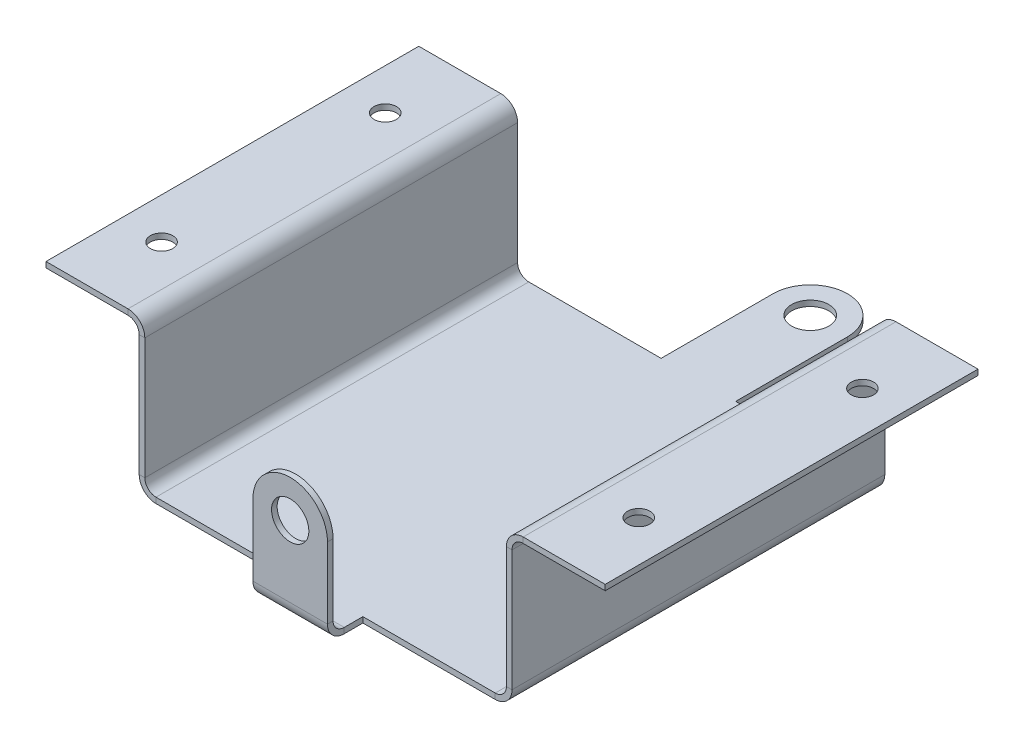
ISO-10303-21;
HEADER;
FILE_DESCRIPTION(('STEP AP214'),'2;1');
FILE_NAME('part.step','',(''),(''),'','','');
FILE_SCHEMA(('AUTOMOTIVE_DESIGN { 1 0 10303 214 1 1 1 1 }'));
ENDSEC;
DATA;
#1=APPLICATION_CONTEXT('core data for automotive mechanical design processes');
#2=APPLICATION_PROTOCOL_DEFINITION('international standard','automotive_design',2000,#1);
#3=PRODUCT_CONTEXT('',#1,'mechanical');
#4=PRODUCT('Part','Part','',(#3));
#5=PRODUCT_RELATED_PRODUCT_CATEGORY('part','',(#4));
#6=PRODUCT_DEFINITION_FORMATION('','',#4);
#7=PRODUCT_DEFINITION_CONTEXT('part definition',#1,'design');
#8=PRODUCT_DEFINITION('design','',#6,#7);
#9=PRODUCT_DEFINITION_SHAPE('','',#8);
#10=(LENGTH_UNIT() NAMED_UNIT(*) SI_UNIT(.MILLI.,.METRE.));
#11=(NAMED_UNIT(*) PLANE_ANGLE_UNIT() SI_UNIT($,.RADIAN.));
#12=(NAMED_UNIT(*) SI_UNIT($,.STERADIAN.) SOLID_ANGLE_UNIT());
#13=UNCERTAINTY_MEASURE_WITH_UNIT(LENGTH_MEASURE(1.E-05),#10,'distance_accuracy_value','');
#14=(GEOMETRIC_REPRESENTATION_CONTEXT(3) GLOBAL_UNCERTAINTY_ASSIGNED_CONTEXT((#13)) GLOBAL_UNIT_ASSIGNED_CONTEXT((#10,
#11,#12)) REPRESENTATION_CONTEXT('',''));
#15=CARTESIAN_POINT('',(0.,0.,0.));
#16=DIRECTION('',(0.,0.,1.));
#17=DIRECTION('',(1.,0.,0.));
#18=AXIS2_PLACEMENT_3D('',#15,#16,#17);
#19=CARTESIAN_POINT('',(0.,-1.5,-80.));
#20=DIRECTION('',(0.,1.,0.));
#21=DIRECTION('',(0.,0.,1.));
#22=AXIS2_PLACEMENT_3D('',#19,#20,#21);
#23=PLANE('',#22);
#24=CARTESIAN_POINT('',(0.,-1.5,-80.));
#25=DIRECTION('',(0.,1.,0.));
#26=DIRECTION('',(0.,0.,1.));
#27=AXIS2_PLACEMENT_3D('',#24,#25,#26);
#28=CIRCLE('',#27,5.00000000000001);
#29=CARTESIAN_POINT('',(0.,-1.5,-75.));
#30=VERTEX_POINT('',#29);
#31=EDGE_CURVE('E573',#30,#30,#28,.T.);
#32=ORIENTED_EDGE('',*,*,#31,.T.);
#33=EDGE_LOOP('',(#32));
#34=FACE_BOUND('',#33,.T.);
#35=DIRECTION('',(0.,0.,-1.));
#36=VECTOR('',#35,1.);
#37=CARTESIAN_POINT('',(9.99999999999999,-1.5,50.));
#38=LINE('',#37,#36);
#39=CARTESIAN_POINT('',(9.99999999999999,-1.5,55.));
#40=VERTEX_POINT('',#39);
#41=CARTESIAN_POINT('',(9.99999999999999,-1.5,50.));
#42=VERTEX_POINT('',#41);
#43=EDGE_CURVE('E123',#40,#42,#38,.T.);
#44=ORIENTED_EDGE('',*,*,#43,.F.);
#45=DIRECTION('',(-1.,0.,0.));
#46=VECTOR('',#45,1.);
#47=CARTESIAN_POINT('',(0.,-1.5,55.));
#48=LINE('',#47,#46);
#49=CARTESIAN_POINT('',(-10.,-1.5,55.));
#50=VERTEX_POINT('',#49);
#51=EDGE_CURVE('E619',#40,#50,#48,.T.);
#52=ORIENTED_EDGE('',*,*,#51,.T.);
#53=DIRECTION('',(0.,0.,1.));
#54=VECTOR('',#53,1.);
#55=CARTESIAN_POINT('',(-10.,-1.5,80.));
#56=LINE('',#55,#54);
#57=CARTESIAN_POINT('',(-10.,-1.5,50.));
#58=VERTEX_POINT('',#57);
#59=EDGE_CURVE('E598',#58,#50,#56,.T.);
#60=ORIENTED_EDGE('',*,*,#59,.F.);
#61=DIRECTION('',(1.,0.,0.));
#62=VECTOR('',#61,1.);
#63=CARTESIAN_POINT('',(-50.,-1.5,50.));
#64=LINE('',#63,#62);
#65=CARTESIAN_POINT('',(-45.5,-1.50000000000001,50.));
#66=VERTEX_POINT('',#65);
#67=EDGE_CURVE('E596',#66,#58,#64,.T.);
#68=ORIENTED_EDGE('',*,*,#67,.F.);
#69=DIRECTION('',(0.,0.,1.));
#70=VECTOR('',#69,1.);
#71=CARTESIAN_POINT('',(-45.5,-1.50000000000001,50.));
#72=LINE('',#71,#70);
#73=CARTESIAN_POINT('',(-45.5,-1.5,-50.));
#74=VERTEX_POINT('',#73);
#75=EDGE_CURVE('E550',#66,#74,#72,.F.);
#76=ORIENTED_EDGE('',*,*,#75,.T.);
#77=DIRECTION('',(-1.,0.,0.));
#78=VECTOR('',#77,1.);
#79=CARTESIAN_POINT('',(-50.,-1.5,-50.));
#80=LINE('',#79,#78);
#81=CARTESIAN_POINT('',(-10.,-1.5,-50.));
#82=VERTEX_POINT('',#81);
#83=EDGE_CURVE('E593',#82,#74,#80,.T.);
#84=ORIENTED_EDGE('',*,*,#83,.F.);
#85=DIRECTION('',(0.,0.,1.));
#86=VECTOR('',#85,1.);
#87=CARTESIAN_POINT('',(-10.,-1.5,-80.));
#88=LINE('',#87,#86);
#89=CARTESIAN_POINT('',(-10.,-1.5,-80.));
#90=VERTEX_POINT('',#89);
#91=EDGE_CURVE('E590',#90,#82,#88,.T.);
#92=ORIENTED_EDGE('',*,*,#91,.F.);
#93=CARTESIAN_POINT('',(0.,-1.5,-80.));
#94=DIRECTION('',(0.,1.,0.));
#95=DIRECTION('',(0.,0.,1.));
#96=AXIS2_PLACEMENT_3D('',#93,#94,#95);
#97=CIRCLE('',#96,10.);
#98=CARTESIAN_POINT('',(10.,-1.5,-80.));
#99=VERTEX_POINT('',#98);
#100=EDGE_CURVE('E587',#99,#90,#97,.T.);
#101=ORIENTED_EDGE('',*,*,#100,.F.);
#102=DIRECTION('',(0.,0.,-1.));
#103=VECTOR('',#102,1.);
#104=CARTESIAN_POINT('',(9.99999999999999,-1.5,-50.));
#105=LINE('',#104,#103);
#106=CARTESIAN_POINT('',(9.99999999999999,-1.5,-50.));
#107=VERTEX_POINT('',#106);
#108=EDGE_CURVE('E584',#107,#99,#105,.T.);
#109=ORIENTED_EDGE('',*,*,#108,.F.);
#110=DIRECTION('',(-1.,0.,0.));
#111=VECTOR('',#110,1.);
#112=CARTESIAN_POINT('',(9.99999999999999,-1.5,-50.));
#113=LINE('',#112,#111);
#114=CARTESIAN_POINT('',(45.5,-1.5,-50.));
#115=VERTEX_POINT('',#114);
#116=EDGE_CURVE('E582',#115,#107,#113,.T.);
#117=ORIENTED_EDGE('',*,*,#116,.F.);
#118=DIRECTION('',(0.,0.,-1.));
#119=VECTOR('',#118,1.);
#120=CARTESIAN_POINT('',(45.5,-1.5,-50.));
#121=LINE('',#120,#119);
#122=CARTESIAN_POINT('',(45.5,-1.5,50.));
#123=VERTEX_POINT('',#122);
#124=EDGE_CURVE('E506',#115,#123,#121,.F.);
#125=ORIENTED_EDGE('',*,*,#124,.T.);
#126=DIRECTION('',(1.,0.,0.));
#127=VECTOR('',#126,1.);
#128=CARTESIAN_POINT('',(9.99999999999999,-1.5,50.));
#129=LINE('',#128,#127);
#130=EDGE_CURVE('E579',#42,#123,#129,.T.);
#131=ORIENTED_EDGE('',*,*,#130,.F.);
#132=EDGE_LOOP('',(#44,#52,#60,#68,#76,#84,#92,#101,#109,#117,#125,#131));
#133=FACE_BOUND('',#132,.T.);
#134=ADVANCED_FACE('F119',(#34,#133),#23,.F.);
#135=CARTESIAN_POINT('',(50.,0.,50.));
#136=DIRECTION('',(0.,0.,-1.));
#137=DIRECTION('',(-1.,0.,0.));
#138=AXIS2_PLACEMENT_3D('',#135,#136,#137);
#139=PLANE('',#138);
#140=DIRECTION('',(-1.,0.,0.));
#141=VECTOR('',#140,1.);
#142=CARTESIAN_POINT('',(50.0000000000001,35.5,50.));
#143=LINE('',#142,#141);
#144=CARTESIAN_POINT('',(50.0000000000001,35.5,50.));
#145=VERTEX_POINT('',#144);
#146=CARTESIAN_POINT('',(48.5000000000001,35.5,50.));
#147=VERTEX_POINT('',#146);
#148=EDGE_CURVE('E416',#145,#147,#143,.T.);
#149=ORIENTED_EDGE('',*,*,#148,.T.);
#150=DIRECTION('',(0.,1.,0.));
#151=VECTOR('',#150,1.);
#152=CARTESIAN_POINT('',(48.5,0.,50.));
#153=LINE('',#152,#151);
#154=CARTESIAN_POINT('',(48.5,2.99999999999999,50.));
#155=VERTEX_POINT('',#154);
#156=EDGE_CURVE('E494',#147,#155,#153,.F.);
#157=ORIENTED_EDGE('',*,*,#156,.T.);
#158=DIRECTION('',(-1.,0.,0.));
#159=VECTOR('',#158,1.);
#160=CARTESIAN_POINT('',(50.,2.99999999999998,50.));
#161=LINE('',#160,#159);
#162=CARTESIAN_POINT('',(50.,2.99999999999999,50.));
#163=VERTEX_POINT('',#162);
#164=EDGE_CURVE('E482',#155,#163,#161,.F.);
#165=ORIENTED_EDGE('',*,*,#164,.T.);
#166=DIRECTION('',(0.,-1.,0.));
#167=VECTOR('',#166,1.);
#168=CARTESIAN_POINT('',(50.,-1.78709569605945E-13,50.));
#169=LINE('',#168,#167);
#170=EDGE_CURVE('E489',#145,#163,#169,.T.);
#171=ORIENTED_EDGE('',*,*,#170,.F.);
#172=EDGE_LOOP('',(#149,#157,#165,#171));
#173=FACE_BOUND('',#172,.T.);
#174=ADVANCED_FACE('F682',(#173),#139,.F.);
#175=CARTESIAN_POINT('',(50.0000000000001,40.,-50.));
#176=DIRECTION('',(0.,0.,1.));
#177=DIRECTION('',(1.,0.,0.));
#178=AXIS2_PLACEMENT_3D('',#175,#176,#177);
#179=PLANE('',#178);
#180=DIRECTION('',(-1.,0.,0.));
#181=VECTOR('',#180,1.);
#182=CARTESIAN_POINT('',(50.0000000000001,35.5000000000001,-50.));
#183=LINE('',#182,#181);
#184=CARTESIAN_POINT('',(50.0000000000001,35.5000000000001,-50.));
#185=VERTEX_POINT('',#184);
#186=CARTESIAN_POINT('',(48.5000000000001,35.5000000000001,-50.));
#187=VERTEX_POINT('',#186);
#188=EDGE_CURVE('E426',#185,#187,#183,.T.);
#189=ORIENTED_EDGE('',*,*,#188,.F.);
#190=DIRECTION('',(0.,1.,0.));
#191=VECTOR('',#190,1.);
#192=CARTESIAN_POINT('',(50.,-1.78709569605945E-13,-50.));
#193=LINE('',#192,#191);
#194=CARTESIAN_POINT('',(50.,2.99999999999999,-50.));
#195=VERTEX_POINT('',#194);
#196=EDGE_CURVE('E485',#195,#185,#193,.T.);
#197=ORIENTED_EDGE('',*,*,#196,.F.);
#198=DIRECTION('',(-1.,0.,0.));
#199=VECTOR('',#198,1.);
#200=CARTESIAN_POINT('',(48.5,3.,-50.));
#201=LINE('',#200,#199);
#202=CARTESIAN_POINT('',(48.5,2.99999999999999,-50.));
#203=VERTEX_POINT('',#202);
#204=EDGE_CURVE('E499',#203,#195,#201,.F.);
#205=ORIENTED_EDGE('',*,*,#204,.F.);
#206=DIRECTION('',(0.,-1.,0.));
#207=VECTOR('',#206,1.);
#208=CARTESIAN_POINT('',(48.5000000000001,40.,-50.));
#209=LINE('',#208,#207);
#210=EDGE_CURVE('E491',#203,#187,#209,.F.);
#211=ORIENTED_EDGE('',*,*,#210,.T.);
#212=EDGE_LOOP('',(#189,#197,#205,#211));
#213=FACE_BOUND('',#212,.T.);
#214=ADVANCED_FACE('F665',(#213),#179,.F.);
#215=CARTESIAN_POINT('',(50.,-1.78709569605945E-13,0.));
#216=DIRECTION('',(-1.,0.,0.));
#217=DIRECTION('',(0.,-1.,0.));
#218=AXIS2_PLACEMENT_3D('',#215,#216,#217);
#219=PLANE('',#218);
#220=DIRECTION('',(0.,0.,1.));
#221=VECTOR('',#220,1.);
#222=CARTESIAN_POINT('',(50.0000000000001,35.5,50.));
#223=LINE('',#222,#221);
#224=EDGE_CURVE('E422',#145,#185,#223,.F.);
#225=ORIENTED_EDGE('',*,*,#224,.F.);
#226=ORIENTED_EDGE('',*,*,#170,.T.);
#227=DIRECTION('',(0.,0.,-1.));
#228=VECTOR('',#227,1.);
#229=CARTESIAN_POINT('',(50.,2.99999999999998,50.));
#230=LINE('',#229,#228);
#231=EDGE_CURVE('E496',#195,#163,#230,.F.);
#232=ORIENTED_EDGE('',*,*,#231,.F.);
#233=ORIENTED_EDGE('',*,*,#196,.T.);
#234=EDGE_LOOP('',(#225,#226,#232,#233));
#235=FACE_BOUND('',#234,.T.);
#236=ADVANCED_FACE('F660',(#235),#219,.F.);
#237=CARTESIAN_POINT('',(48.5,-1.73472347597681E-13,0.));
#238=DIRECTION('',(-1.,0.,0.));
#239=DIRECTION('',(0.,-1.,0.));
#240=AXIS2_PLACEMENT_3D('',#237,#238,#239);
#241=PLANE('',#240);
#242=ORIENTED_EDGE('',*,*,#156,.F.);
#243=DIRECTION('',(0.,0.,1.));
#244=VECTOR('',#243,1.);
#245=CARTESIAN_POINT('',(48.5000000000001,35.5,50.));
#246=LINE('',#245,#244);
#247=EDGE_CURVE('E409',#147,#187,#246,.F.);
#248=ORIENTED_EDGE('',*,*,#247,.T.);
#249=ORIENTED_EDGE('',*,*,#210,.F.);
#250=DIRECTION('',(0.,0.,-1.));
#251=VECTOR('',#250,1.);
#252=CARTESIAN_POINT('',(48.5,2.99999999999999,50.));
#253=LINE('',#252,#251);
#254=EDGE_CURVE('E502',#155,#203,#253,.T.);
#255=ORIENTED_EDGE('',*,*,#254,.F.);
#256=EDGE_LOOP('',(#242,#248,#249,#255));
#257=FACE_BOUND('',#256,.T.);
#258=ADVANCED_FACE('F672',(#257),#241,.T.);
#259=CARTESIAN_POINT('',(-50.0000000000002,40.,50.));
#260=DIRECTION('',(0.,0.,-1.));
#261=DIRECTION('',(-1.,0.,0.));
#262=AXIS2_PLACEMENT_3D('',#259,#260,#261);
#263=PLANE('',#262);
#264=DIRECTION('',(1.,0.,0.));
#265=VECTOR('',#264,1.);
#266=CARTESIAN_POINT('',(-50.0000000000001,35.4999999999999,50.));
#267=LINE('',#266,#265);
#268=CARTESIAN_POINT('',(-50.0000000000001,35.4999999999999,50.));
#269=VERTEX_POINT('',#268);
#270=CARTESIAN_POINT('',(-48.5000000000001,35.4999999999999,50.));
#271=VERTEX_POINT('',#270);
#272=EDGE_CURVE('E479',#269,#271,#267,.T.);
#273=ORIENTED_EDGE('',*,*,#272,.F.);
#274=DIRECTION('',(0.,1.,0.));
#275=VECTOR('',#274,1.);
#276=CARTESIAN_POINT('',(-50.,-1.78709569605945E-13,50.));
#277=LINE('',#276,#275);
#278=CARTESIAN_POINT('',(-50.,2.99999999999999,50.));
#279=VERTEX_POINT('',#278);
#280=EDGE_CURVE('E532',#279,#269,#277,.T.);
#281=ORIENTED_EDGE('',*,*,#280,.F.);
#282=DIRECTION('',(1.,0.,0.));
#283=VECTOR('',#282,1.);
#284=CARTESIAN_POINT('',(-48.5,3.,50.));
#285=LINE('',#284,#283);
#286=CARTESIAN_POINT('',(-48.5000000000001,2.99999999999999,50.));
#287=VERTEX_POINT('',#286);
#288=EDGE_CURVE('E543',#287,#279,#285,.F.);
#289=ORIENTED_EDGE('',*,*,#288,.F.);
#290=DIRECTION('',(0.,-1.,0.));
#291=VECTOR('',#290,1.);
#292=CARTESIAN_POINT('',(-48.5000000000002,40.,50.));
#293=LINE('',#292,#291);
#294=EDGE_CURVE('E537',#287,#271,#293,.F.);
#295=ORIENTED_EDGE('',*,*,#294,.T.);
#296=EDGE_LOOP('',(#273,#281,#289,#295));
#297=FACE_BOUND('',#296,.T.);
#298=ADVANCED_FACE('F735',(#297),#263,.F.);
#299=CARTESIAN_POINT('',(-50.,0.,-50.));
#300=DIRECTION('',(0.,0.,1.));
#301=DIRECTION('',(1.,0.,0.));
#302=AXIS2_PLACEMENT_3D('',#299,#300,#301);
#303=PLANE('',#302);
#304=DIRECTION('',(1.,0.,0.));
#305=VECTOR('',#304,1.);
#306=CARTESIAN_POINT('',(-50.0000000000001,35.5,-50.));
#307=LINE('',#306,#305);
#308=CARTESIAN_POINT('',(-50.0000000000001,35.5,-50.));
#309=VERTEX_POINT('',#308);
#310=CARTESIAN_POINT('',(-48.5000000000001,35.5,-50.));
#311=VERTEX_POINT('',#310);
#312=EDGE_CURVE('E469',#309,#311,#307,.T.);
#313=ORIENTED_EDGE('',*,*,#312,.T.);
#314=DIRECTION('',(0.,1.,0.));
#315=VECTOR('',#314,1.);
#316=CARTESIAN_POINT('',(-48.5,0.,-50.));
#317=LINE('',#316,#315);
#318=CARTESIAN_POINT('',(-48.5000000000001,2.99999999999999,-50.));
#319=VERTEX_POINT('',#318);
#320=EDGE_CURVE('E535',#311,#319,#317,.F.);
#321=ORIENTED_EDGE('',*,*,#320,.T.);
#322=DIRECTION('',(1.,0.,0.));
#323=VECTOR('',#322,1.);
#324=CARTESIAN_POINT('',(-50.,2.99999999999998,-50.));
#325=LINE('',#324,#323);
#326=CARTESIAN_POINT('',(-50.0000000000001,2.99999999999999,-50.));
#327=VERTEX_POINT('',#326);
#328=EDGE_CURVE('E526',#319,#327,#325,.F.);
#329=ORIENTED_EDGE('',*,*,#328,.T.);
#330=DIRECTION('',(0.,-1.,0.));
#331=VECTOR('',#330,1.);
#332=CARTESIAN_POINT('',(-50.,-1.78709569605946E-13,-50.));
#333=LINE('',#332,#331);
#334=EDGE_CURVE('E529',#309,#327,#333,.T.);
#335=ORIENTED_EDGE('',*,*,#334,.F.);
#336=EDGE_LOOP('',(#313,#321,#329,#335));
#337=FACE_BOUND('',#336,.T.);
#338=ADVANCED_FACE('F729',(#337),#303,.F.);
#339=CARTESIAN_POINT('',(-50.,-1.78709569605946E-13,0.));
#340=DIRECTION('',(1.,0.,0.));
#341=DIRECTION('',(0.,1.,0.));
#342=AXIS2_PLACEMENT_3D('',#339,#340,#341);
#343=PLANE('',#342);
#344=DIRECTION('',(0.,0.,-1.));
#345=VECTOR('',#344,1.);
#346=CARTESIAN_POINT('',(-50.0000000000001,35.5,-50.));
#347=LINE('',#346,#345);
#348=EDGE_CURVE('E475',#309,#269,#347,.F.);
#349=ORIENTED_EDGE('',*,*,#348,.F.);
#350=ORIENTED_EDGE('',*,*,#334,.T.);
#351=DIRECTION('',(0.,0.,1.));
#352=VECTOR('',#351,1.);
#353=CARTESIAN_POINT('',(-50.0000000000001,2.99999999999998,-50.));
#354=LINE('',#353,#352);
#355=EDGE_CURVE('E540',#279,#327,#354,.F.);
#356=ORIENTED_EDGE('',*,*,#355,.F.);
#357=ORIENTED_EDGE('',*,*,#280,.T.);
#358=EDGE_LOOP('',(#349,#350,#356,#357));
#359=FACE_BOUND('',#358,.T.);
#360=ADVANCED_FACE('F723',(#359),#343,.F.);
#361=CARTESIAN_POINT('',(-48.5,-1.73472347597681E-13,0.));
#362=DIRECTION('',(1.,0.,0.));
#363=DIRECTION('',(0.,1.,0.));
#364=AXIS2_PLACEMENT_3D('',#361,#362,#363);
#365=PLANE('',#364);
#366=ORIENTED_EDGE('',*,*,#320,.F.);
#367=DIRECTION('',(0.,0.,-1.));
#368=VECTOR('',#367,1.);
#369=CARTESIAN_POINT('',(-48.5000000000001,35.5,-50.));
#370=LINE('',#369,#368);
#371=EDGE_CURVE('E462',#311,#271,#370,.F.);
#372=ORIENTED_EDGE('',*,*,#371,.T.);
#373=ORIENTED_EDGE('',*,*,#294,.F.);
#374=DIRECTION('',(0.,0.,1.));
#375=VECTOR('',#374,1.);
#376=CARTESIAN_POINT('',(-48.5000000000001,2.99999999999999,-50.));
#377=LINE('',#376,#375);
#378=EDGE_CURVE('E546',#319,#287,#377,.T.);
#379=ORIENTED_EDGE('',*,*,#378,.F.);
#380=EDGE_LOOP('',(#366,#372,#373,#379));
#381=FACE_BOUND('',#380,.T.);
#382=ADVANCED_FACE('F717',(#381),#365,.T.);
#383=CARTESIAN_POINT('',(0.,0.,-80.));
#384=DIRECTION('',(0.,1.,0.));
#385=DIRECTION('',(0.,0.,1.));
#386=AXIS2_PLACEMENT_3D('',#383,#384,#385);
#387=PLANE('',#386);
#388=DIRECTION('',(-1.,0.,0.));
#389=VECTOR('',#388,1.);
#390=CARTESIAN_POINT('',(0.,0.,55.));
#391=LINE('',#390,#389);
#392=CARTESIAN_POINT('',(9.99999999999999,0.,55.));
#393=VERTEX_POINT('',#392);
#394=CARTESIAN_POINT('',(-10.,0.,55.));
#395=VERTEX_POINT('',#394);
#396=EDGE_CURVE('E128',#393,#395,#391,.T.);
#397=ORIENTED_EDGE('',*,*,#396,.F.);
#398=DIRECTION('',(0.,0.,-1.));
#399=VECTOR('',#398,1.);
#400=CARTESIAN_POINT('',(9.99999999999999,0.,50.));
#401=LINE('',#400,#399);
#402=CARTESIAN_POINT('',(9.99999999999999,0.,50.));
#403=VERTEX_POINT('',#402);
#404=EDGE_CURVE('E144',#393,#403,#401,.T.);
#405=ORIENTED_EDGE('',*,*,#404,.T.);
#406=DIRECTION('',(1.,0.,0.));
#407=VECTOR('',#406,1.);
#408=CARTESIAN_POINT('',(9.99999999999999,0.,50.));
#409=LINE('',#408,#407);
#410=CARTESIAN_POINT('',(45.5,0.,50.));
#411=VERTEX_POINT('',#410);
#412=EDGE_CURVE('E576',#403,#411,#409,.T.);
#413=ORIENTED_EDGE('',*,*,#412,.T.);
#414=DIRECTION('',(0.,0.,-1.));
#415=VECTOR('',#414,1.);
#416=CARTESIAN_POINT('',(45.5,0.,-50.));
#417=LINE('',#416,#415);
#418=CARTESIAN_POINT('',(45.5,0.,-50.));
#419=VERTEX_POINT('',#418);
#420=EDGE_CURVE('E518',#419,#411,#417,.F.);
#421=ORIENTED_EDGE('',*,*,#420,.F.);
#422=DIRECTION('',(-1.,0.,0.));
#423=VECTOR('',#422,1.);
#424=CARTESIAN_POINT('',(9.99999999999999,0.,-50.));
#425=LINE('',#424,#423);
#426=CARTESIAN_POINT('',(9.99999999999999,0.,-50.));
#427=VERTEX_POINT('',#426);
#428=EDGE_CURVE('E601',#419,#427,#425,.T.);
#429=ORIENTED_EDGE('',*,*,#428,.T.);
#430=DIRECTION('',(0.,0.,-1.));
#431=VECTOR('',#430,1.);
#432=CARTESIAN_POINT('',(9.99999999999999,0.,-50.));
#433=LINE('',#432,#431);
#434=CARTESIAN_POINT('',(10.,0.,-80.));
#435=VERTEX_POINT('',#434);
#436=EDGE_CURVE('E603',#427,#435,#433,.T.);
#437=ORIENTED_EDGE('',*,*,#436,.T.);
#438=CARTESIAN_POINT('',(0.,0.,-80.));
#439=DIRECTION('',(0.,1.,0.));
#440=DIRECTION('',(0.,0.,1.));
#441=AXIS2_PLACEMENT_3D('',#438,#439,#440);
#442=CIRCLE('',#441,10.);
#443=CARTESIAN_POINT('',(-10.,0.,-80.));
#444=VERTEX_POINT('',#443);
#445=EDGE_CURVE('E606',#435,#444,#442,.T.);
#446=ORIENTED_EDGE('',*,*,#445,.T.);
#447=DIRECTION('',(0.,0.,1.));
#448=VECTOR('',#447,1.);
#449=CARTESIAN_POINT('',(-10.,0.,-80.));
#450=LINE('',#449,#448);
#451=CARTESIAN_POINT('',(-10.,0.,-50.));
#452=VERTEX_POINT('',#451);
#453=EDGE_CURVE('E609',#444,#452,#450,.T.);
#454=ORIENTED_EDGE('',*,*,#453,.T.);
#455=DIRECTION('',(-1.,0.,0.));
#456=VECTOR('',#455,1.);
#457=CARTESIAN_POINT('',(-50.,0.,-50.));
#458=LINE('',#457,#456);
#459=CARTESIAN_POINT('',(-45.5,0.,-50.));
#460=VERTEX_POINT('',#459);
#461=EDGE_CURVE('E612',#452,#460,#458,.T.);
#462=ORIENTED_EDGE('',*,*,#461,.T.);
#463=DIRECTION('',(0.,0.,1.));
#464=VECTOR('',#463,1.);
#465=CARTESIAN_POINT('',(-45.5,0.,50.));
#466=LINE('',#465,#464);
#467=CARTESIAN_POINT('',(-45.5,0.,50.));
#468=VERTEX_POINT('',#467);
#469=EDGE_CURVE('E562',#468,#460,#466,.F.);
#470=ORIENTED_EDGE('',*,*,#469,.F.);
#471=DIRECTION('',(1.,0.,0.));
#472=VECTOR('',#471,1.);
#473=CARTESIAN_POINT('',(-50.,0.,50.));
#474=LINE('',#473,#472);
#475=CARTESIAN_POINT('',(-10.,0.,50.));
#476=VERTEX_POINT('',#475);
#477=EDGE_CURVE('E615',#468,#476,#474,.T.);
#478=ORIENTED_EDGE('',*,*,#477,.T.);
#479=DIRECTION('',(0.,0.,1.));
#480=VECTOR('',#479,1.);
#481=CARTESIAN_POINT('',(-10.,0.,80.));
#482=LINE('',#481,#480);
#483=EDGE_CURVE('E136',#476,#395,#482,.T.);
#484=ORIENTED_EDGE('',*,*,#483,.T.);
#485=EDGE_LOOP('',(#397,#405,#413,#421,#429,#437,#446,#454,#462,#470,#478,#484));
#486=FACE_BOUND('',#485,.T.);
#487=CARTESIAN_POINT('',(0.,0.,-80.));
#488=DIRECTION('',(0.,1.,0.));
#489=DIRECTION('',(0.,0.,1.));
#490=AXIS2_PLACEMENT_3D('',#487,#488,#489);
#491=CIRCLE('',#490,5.00000000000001);
#492=CARTESIAN_POINT('',(0.,0.,-75.));
#493=VERTEX_POINT('',#492);
#494=EDGE_CURVE('E570',#493,#493,#491,.T.);
#495=ORIENTED_EDGE('',*,*,#494,.F.);
#496=EDGE_LOOP('',(#495));
#497=FACE_BOUND('',#496,.T.);
#498=ADVANCED_FACE('F640',(#486,#497),#387,.T.);
#499=CARTESIAN_POINT('',(9.99999999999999,-1.5,-50.));
#500=DIRECTION('',(0.,0.,-1.));
#501=DIRECTION('',(-1.,0.,0.));
#502=AXIS2_PLACEMENT_3D('',#499,#500,#501);
#503=PLANE('',#502);
#504=ORIENTED_EDGE('',*,*,#428,.F.);
#505=DIRECTION('',(0.,-1.,0.));
#506=VECTOR('',#505,1.);
#507=CARTESIAN_POINT('',(45.5,0.,-50.));
#508=LINE('',#507,#506);
#509=EDGE_CURVE('E512',#419,#115,#508,.T.);
#510=ORIENTED_EDGE('',*,*,#509,.T.);
#511=ORIENTED_EDGE('',*,*,#116,.T.);
#512=DIRECTION('',(0.,1.,0.));
#513=VECTOR('',#512,1.);
#514=CARTESIAN_POINT('',(9.99999999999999,-1.5,-50.));
#515=LINE('',#514,#513);
#516=EDGE_CURVE('E629',#107,#427,#515,.T.);
#517=ORIENTED_EDGE('',*,*,#516,.T.);
#518=EDGE_LOOP('',(#504,#510,#511,#517));
#519=FACE_BOUND('',#518,.T.);
#520=ADVANCED_FACE('F689',(#519),#503,.T.);
#521=CARTESIAN_POINT('',(-50.,-1.5,50.));
#522=DIRECTION('',(0.,0.,1.));
#523=DIRECTION('',(1.,0.,0.));
#524=AXIS2_PLACEMENT_3D('',#521,#522,#523);
#525=PLANE('',#524);
#526=ORIENTED_EDGE('',*,*,#477,.F.);
#527=DIRECTION('',(0.,-1.,0.));
#528=VECTOR('',#527,1.);
#529=CARTESIAN_POINT('',(-45.5,0.,50.));
#530=LINE('',#529,#528);
#531=EDGE_CURVE('E556',#468,#66,#530,.T.);
#532=ORIENTED_EDGE('',*,*,#531,.T.);
#533=ORIENTED_EDGE('',*,*,#67,.T.);
#534=DIRECTION('',(0.,1.,0.));
#535=VECTOR('',#534,1.);
#536=CARTESIAN_POINT('',(-10.,-1.5,50.));
#537=LINE('',#536,#535);
#538=EDGE_CURVE('E620',#58,#476,#537,.T.);
#539=ORIENTED_EDGE('',*,*,#538,.T.);
#540=EDGE_LOOP('',(#526,#532,#533,#539));
#541=FACE_BOUND('',#540,.T.);
#542=ADVANCED_FACE('F722',(#541),#525,.T.);
#543=CARTESIAN_POINT('',(9.99999999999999,-1.5,50.));
#544=DIRECTION('',(0.,0.,1.));
#545=DIRECTION('',(1.,0.,0.));
#546=AXIS2_PLACEMENT_3D('',#543,#544,#545);
#547=PLANE('',#546);
#548=DIRECTION('',(0.,-1.,0.));
#549=VECTOR('',#548,1.);
#550=CARTESIAN_POINT('',(45.5,0.,50.));
#551=LINE('',#550,#549);
#552=EDGE_CURVE('E523',#411,#123,#551,.T.);
#553=ORIENTED_EDGE('',*,*,#552,.F.);
#554=ORIENTED_EDGE('',*,*,#412,.F.);
#555=DIRECTION('',(0.,1.,0.));
#556=VECTOR('',#555,1.);
#557=CARTESIAN_POINT('',(9.99999999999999,-1.5,50.));
#558=LINE('',#557,#556);
#559=EDGE_CURVE('E617',#42,#403,#558,.T.);
#560=ORIENTED_EDGE('',*,*,#559,.F.);
#561=ORIENTED_EDGE('',*,*,#130,.T.);
#562=EDGE_LOOP('',(#553,#554,#560,#561));
#563=FACE_BOUND('',#562,.T.);
#564=ADVANCED_FACE('F647',(#563),#547,.T.);
#565=CARTESIAN_POINT('',(9.99999999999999,-1.5,50.));
#566=DIRECTION('',(1.,0.,0.));
#567=DIRECTION('',(0.,0.,-1.));
#568=AXIS2_PLACEMENT_3D('',#565,#566,#567);
#569=PLANE('',#568);
#570=DIRECTION('',(0.,1.,0.));
#571=VECTOR('',#570,1.);
#572=CARTESIAN_POINT('',(9.99999999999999,-1.5,55.));
#573=LINE('',#572,#571);
#574=EDGE_CURVE('E634',#40,#393,#573,.T.);
#575=ORIENTED_EDGE('',*,*,#574,.F.);
#576=ORIENTED_EDGE('',*,*,#43,.T.);
#577=ORIENTED_EDGE('',*,*,#559,.T.);
#578=ORIENTED_EDGE('',*,*,#404,.F.);
#579=EDGE_LOOP('',(#575,#576,#577,#578));
#580=FACE_BOUND('',#579,.T.);
#581=ADVANCED_FACE('F644',(#580),#569,.T.);
#582=CARTESIAN_POINT('',(-10.,-1.5,80.));
#583=DIRECTION('',(-1.,0.,0.));
#584=DIRECTION('',(0.,0.,1.));
#585=AXIS2_PLACEMENT_3D('',#582,#583,#584);
#586=PLANE('',#585);
#587=DIRECTION('',(0.,-1.,0.));
#588=VECTOR('',#587,1.);
#589=CARTESIAN_POINT('',(-10.,-1.5,55.));
#590=LINE('',#589,#588);
#591=EDGE_CURVE('E13',#395,#50,#590,.T.);
#592=ORIENTED_EDGE('',*,*,#591,.F.);
#593=ORIENTED_EDGE('',*,*,#483,.F.);
#594=ORIENTED_EDGE('',*,*,#538,.F.);
#595=ORIENTED_EDGE('',*,*,#59,.T.);
#596=EDGE_LOOP('',(#592,#593,#594,#595));
#597=FACE_BOUND('',#596,.T.);
#598=ADVANCED_FACE('F121',(#597),#586,.T.);
#599=CARTESIAN_POINT('',(-50.,-1.5,-50.));
#600=DIRECTION('',(0.,0.,-1.));
#601=DIRECTION('',(-1.,0.,0.));
#602=AXIS2_PLACEMENT_3D('',#599,#600,#601);
#603=PLANE('',#602);
#604=DIRECTION('',(0.,-1.,0.));
#605=VECTOR('',#604,1.);
#606=CARTESIAN_POINT('',(-45.5,0.,-50.));
#607=LINE('',#606,#605);
#608=EDGE_CURVE('E567',#460,#74,#607,.T.);
#609=ORIENTED_EDGE('',*,*,#608,.F.);
#610=ORIENTED_EDGE('',*,*,#461,.F.);
#611=DIRECTION('',(0.,1.,0.));
#612=VECTOR('',#611,1.);
#613=CARTESIAN_POINT('',(-10.,-1.5,-50.));
#614=LINE('',#613,#612);
#615=EDGE_CURVE('E623',#82,#452,#614,.T.);
#616=ORIENTED_EDGE('',*,*,#615,.F.);
#617=ORIENTED_EDGE('',*,*,#83,.T.);
#618=EDGE_LOOP('',(#609,#610,#616,#617));
#619=FACE_BOUND('',#618,.T.);
#620=ADVANCED_FACE('F763',(#619),#603,.T.);
#621=CARTESIAN_POINT('',(-10.,-1.5,-80.));
#622=DIRECTION('',(-1.,0.,0.));
#623=DIRECTION('',(0.,0.,1.));
#624=AXIS2_PLACEMENT_3D('',#621,#622,#623);
#625=PLANE('',#624);
#626=ORIENTED_EDGE('',*,*,#453,.F.);
#627=DIRECTION('',(0.,1.,0.));
#628=VECTOR('',#627,1.);
#629=CARTESIAN_POINT('',(-10.,-1.5,-80.));
#630=LINE('',#629,#628);
#631=EDGE_CURVE('E625',#90,#444,#630,.T.);
#632=ORIENTED_EDGE('',*,*,#631,.F.);
#633=ORIENTED_EDGE('',*,*,#91,.T.);
#634=ORIENTED_EDGE('',*,*,#615,.T.);
#635=EDGE_LOOP('',(#626,#632,#633,#634));
#636=FACE_BOUND('',#635,.T.);
#637=ADVANCED_FACE('F766',(#636),#625,.T.);
#638=CARTESIAN_POINT('',(0.,-1.5,-80.));
#639=DIRECTION('',(0.,1.,0.));
#640=DIRECTION('',(0.,0.,1.));
#641=AXIS2_PLACEMENT_3D('',#638,#639,#640);
#642=CYLINDRICAL_SURFACE('',#641,10.);
#643=ORIENTED_EDGE('',*,*,#445,.F.);
#644=DIRECTION('',(0.,1.,0.));
#645=VECTOR('',#644,1.);
#646=CARTESIAN_POINT('',(10.,-1.5,-80.));
#647=LINE('',#646,#645);
#648=EDGE_CURVE('E627',#99,#435,#647,.T.);
#649=ORIENTED_EDGE('',*,*,#648,.F.);
#650=ORIENTED_EDGE('',*,*,#100,.T.);
#651=ORIENTED_EDGE('',*,*,#631,.T.);
#652=EDGE_LOOP('',(#643,#649,#650,#651));
#653=FACE_BOUND('',#652,.T.);
#654=ADVANCED_FACE('F770',(#653),#642,.T.);
#655=CARTESIAN_POINT('',(9.99999999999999,-1.5,-50.));
#656=DIRECTION('',(1.,0.,0.));
#657=DIRECTION('',(0.,0.,-1.));
#658=AXIS2_PLACEMENT_3D('',#655,#656,#657);
#659=PLANE('',#658);
#660=ORIENTED_EDGE('',*,*,#436,.F.);
#661=ORIENTED_EDGE('',*,*,#516,.F.);
#662=ORIENTED_EDGE('',*,*,#108,.T.);
#663=ORIENTED_EDGE('',*,*,#648,.T.);
#664=EDGE_LOOP('',(#660,#661,#662,#663));
#665=FACE_BOUND('',#664,.T.);
#666=ADVANCED_FACE('F758',(#665),#659,.T.);
#667=CARTESIAN_POINT('',(0.,-1.5,-80.));
#668=DIRECTION('',(0.,1.,0.));
#669=DIRECTION('',(0.,0.,1.));
#670=AXIS2_PLACEMENT_3D('',#667,#668,#669);
#671=CYLINDRICAL_SURFACE('',#670,5.00000000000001);
#672=ORIENTED_EDGE('',*,*,#31,.F.);
#673=EDGE_LOOP('',(#672));
#674=FACE_BOUND('',#673,.T.);
#675=ORIENTED_EDGE('',*,*,#494,.T.);
#676=EDGE_LOOP('',(#675));
#677=FACE_BOUND('',#676,.T.);
#678=ADVANCED_FACE('F751',(#674,#677),#671,.F.);
#679=CARTESIAN_POINT('',(-45.5,3.,-50.));
#680=DIRECTION('',(0.,0.,-1.));
#681=DIRECTION('',(-1.,0.,0.));
#682=AXIS2_PLACEMENT_3D('',#679,#680,#681);
#683=PLANE('',#682);
#684=ORIENTED_EDGE('',*,*,#328,.F.);
#685=CARTESIAN_POINT('',(-45.5,3.,-50.));
#686=DIRECTION('',(0.,0.,1.));
#687=DIRECTION('',(1.,0.,0.));
#688=AXIS2_PLACEMENT_3D('',#685,#686,#687);
#689=CIRCLE('',#688,3.00000000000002);
#690=EDGE_CURVE('E559',#460,#319,#689,.F.);
#691=ORIENTED_EDGE('',*,*,#690,.F.);
#692=ORIENTED_EDGE('',*,*,#608,.T.);
#693=CARTESIAN_POINT('',(-45.5,3.,-50.));
#694=DIRECTION('',(0.,0.,1.));
#695=DIRECTION('',(1.,0.,0.));
#696=AXIS2_PLACEMENT_3D('',#693,#694,#695);
#697=CIRCLE('',#696,4.50000000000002);
#698=EDGE_CURVE('E552',#74,#327,#697,.F.);
#699=ORIENTED_EDGE('',*,*,#698,.T.);
#700=EDGE_LOOP('',(#684,#691,#692,#699));
#701=FACE_BOUND('',#700,.T.);
#702=ADVANCED_FACE('F748',(#701),#683,.T.);
#703=CARTESIAN_POINT('',(-45.5,3.,50.));
#704=DIRECTION('',(0.,0.,-1.));
#705=DIRECTION('',(-1.,0.,0.));
#706=AXIS2_PLACEMENT_3D('',#703,#704,#705);
#707=PLANE('',#706);
#708=CARTESIAN_POINT('',(-45.5,3.,50.));
#709=DIRECTION('',(0.,0.,1.));
#710=DIRECTION('',(1.,0.,0.));
#711=AXIS2_PLACEMENT_3D('',#708,#709,#710);
#712=CIRCLE('',#711,3.00000000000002);
#713=EDGE_CURVE('E531',#287,#468,#712,.T.);
#714=ORIENTED_EDGE('',*,*,#713,.F.);
#715=ORIENTED_EDGE('',*,*,#288,.T.);
#716=CARTESIAN_POINT('',(-45.5,3.,50.));
#717=DIRECTION('',(0.,0.,1.));
#718=DIRECTION('',(1.,0.,0.));
#719=AXIS2_PLACEMENT_3D('',#716,#717,#718);
#720=CIRCLE('',#719,4.50000000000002);
#721=EDGE_CURVE('E553',#279,#66,#720,.T.);
#722=ORIENTED_EDGE('',*,*,#721,.T.);
#723=ORIENTED_EDGE('',*,*,#531,.F.);
#724=EDGE_LOOP('',(#714,#715,#722,#723));
#725=FACE_BOUND('',#724,.T.);
#726=ADVANCED_FACE('F743',(#725),#707,.F.);
#727=CARTESIAN_POINT('',(-45.5,3.,50.));
#728=DIRECTION('',(0.,0.,1.));
#729=DIRECTION('',(-1.,0.,0.));
#730=AXIS2_PLACEMENT_3D('',#727,#728,#729);
#731=CYLINDRICAL_SURFACE('',#730,4.50000000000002);
#732=ORIENTED_EDGE('',*,*,#75,.F.);
#733=ORIENTED_EDGE('',*,*,#721,.F.);
#734=ORIENTED_EDGE('',*,*,#355,.T.);
#735=ORIENTED_EDGE('',*,*,#698,.F.);
#736=EDGE_LOOP('',(#732,#733,#734,#735));
#737=FACE_BOUND('',#736,.T.);
#738=ADVANCED_FACE('F740',(#737),#731,.T.);
#739=CARTESIAN_POINT('',(-45.5,3.,50.));
#740=DIRECTION('',(0.,0.,1.));
#741=DIRECTION('',(-1.,0.,0.));
#742=AXIS2_PLACEMENT_3D('',#739,#740,#741);
#743=CYLINDRICAL_SURFACE('',#742,3.00000000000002);
#744=ORIENTED_EDGE('',*,*,#469,.T.);
#745=ORIENTED_EDGE('',*,*,#690,.T.);
#746=ORIENTED_EDGE('',*,*,#378,.T.);
#747=ORIENTED_EDGE('',*,*,#713,.T.);
#748=EDGE_LOOP('',(#744,#745,#746,#747));
#749=FACE_BOUND('',#748,.T.);
#750=ADVANCED_FACE('F701',(#749),#743,.F.);
#751=CARTESIAN_POINT('',(45.5,3.,50.));
#752=DIRECTION('',(0.,0.,1.));
#753=DIRECTION('',(1.,0.,0.));
#754=AXIS2_PLACEMENT_3D('',#751,#752,#753);
#755=PLANE('',#754);
#756=ORIENTED_EDGE('',*,*,#164,.F.);
#757=CARTESIAN_POINT('',(45.5,3.,50.));
#758=DIRECTION('',(0.,0.,-1.));
#759=DIRECTION('',(-1.,0.,0.));
#760=AXIS2_PLACEMENT_3D('',#757,#758,#759);
#761=CIRCLE('',#760,3.);
#762=EDGE_CURVE('E515',#411,#155,#761,.F.);
#763=ORIENTED_EDGE('',*,*,#762,.F.);
#764=ORIENTED_EDGE('',*,*,#552,.T.);
#765=CARTESIAN_POINT('',(45.5,3.,50.));
#766=DIRECTION('',(0.,0.,-1.));
#767=DIRECTION('',(-1.,0.,0.));
#768=AXIS2_PLACEMENT_3D('',#765,#766,#767);
#769=CIRCLE('',#768,4.5);
#770=EDGE_CURVE('E508',#123,#163,#769,.F.);
#771=ORIENTED_EDGE('',*,*,#770,.T.);
#772=EDGE_LOOP('',(#756,#763,#764,#771));
#773=FACE_BOUND('',#772,.T.);
#774=ADVANCED_FACE('F652',(#773),#755,.T.);
#775=CARTESIAN_POINT('',(45.5,3.,-50.));
#776=DIRECTION('',(0.,0.,1.));
#777=DIRECTION('',(1.,0.,0.));
#778=AXIS2_PLACEMENT_3D('',#775,#776,#777);
#779=PLANE('',#778);
#780=CARTESIAN_POINT('',(45.5,3.,-50.));
#781=DIRECTION('',(0.,0.,-1.));
#782=DIRECTION('',(-1.,0.,0.));
#783=AXIS2_PLACEMENT_3D('',#780,#781,#782);
#784=CIRCLE('',#783,3.);
#785=EDGE_CURVE('E488',#203,#419,#784,.T.);
#786=ORIENTED_EDGE('',*,*,#785,.F.);
#787=ORIENTED_EDGE('',*,*,#204,.T.);
#788=CARTESIAN_POINT('',(45.5,3.,-50.));
#789=DIRECTION('',(0.,0.,-1.));
#790=DIRECTION('',(-1.,0.,0.));
#791=AXIS2_PLACEMENT_3D('',#788,#789,#790);
#792=CIRCLE('',#791,4.5);
#793=EDGE_CURVE('E509',#195,#115,#792,.T.);
#794=ORIENTED_EDGE('',*,*,#793,.T.);
#795=ORIENTED_EDGE('',*,*,#509,.F.);
#796=EDGE_LOOP('',(#786,#787,#794,#795));
#797=FACE_BOUND('',#796,.T.);
#798=ADVANCED_FACE('F693',(#797),#779,.F.);
#799=CARTESIAN_POINT('',(45.5,3.,-50.));
#800=DIRECTION('',(0.,0.,-1.));
#801=DIRECTION('',(1.,0.,0.));
#802=AXIS2_PLACEMENT_3D('',#799,#800,#801);
#803=CYLINDRICAL_SURFACE('',#802,4.5);
#804=ORIENTED_EDGE('',*,*,#124,.F.);
#805=ORIENTED_EDGE('',*,*,#793,.F.);
#806=ORIENTED_EDGE('',*,*,#231,.T.);
#807=ORIENTED_EDGE('',*,*,#770,.F.);
#808=EDGE_LOOP('',(#804,#805,#806,#807));
#809=FACE_BOUND('',#808,.T.);
#810=ADVANCED_FACE('F655',(#809),#803,.T.);
#811=CARTESIAN_POINT('',(45.5,3.,-50.));
#812=DIRECTION('',(0.,0.,-1.));
#813=DIRECTION('',(1.,0.,0.));
#814=AXIS2_PLACEMENT_3D('',#811,#812,#813);
#815=CYLINDRICAL_SURFACE('',#814,3.);
#816=ORIENTED_EDGE('',*,*,#420,.T.);
#817=ORIENTED_EDGE('',*,*,#762,.T.);
#818=ORIENTED_EDGE('',*,*,#254,.T.);
#819=ORIENTED_EDGE('',*,*,#785,.T.);
#820=EDGE_LOOP('',(#816,#817,#818,#819));
#821=FACE_BOUND('',#820,.T.);
#822=ADVANCED_FACE('F684',(#821),#815,.F.);
#823=CARTESIAN_POINT('',(-53.0000000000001,35.4999999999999,50.));
#824=DIRECTION('',(0.,0.,1.));
#825=DIRECTION('',(0.,-1.,0.));
#826=AXIS2_PLACEMENT_3D('',#823,#824,#825);
#827=PLANE('',#826);
#828=DIRECTION('',(0.,-1.,0.));
#829=VECTOR('',#828,1.);
#830=CARTESIAN_POINT('',(-53.0000000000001,40.,50.));
#831=LINE('',#830,#829);
#832=CARTESIAN_POINT('',(-53.0000000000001,38.5,50.));
#833=VERTEX_POINT('',#832);
#834=CARTESIAN_POINT('',(-53.0000000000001,40.,50.));
#835=VERTEX_POINT('',#834);
#836=EDGE_CURVE('E429',#833,#835,#831,.F.);
#837=ORIENTED_EDGE('',*,*,#836,.F.);
#838=CARTESIAN_POINT('',(-53.0000000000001,35.4999999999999,50.));
#839=DIRECTION('',(0.,0.,-1.));
#840=DIRECTION('',(0.,1.,0.));
#841=AXIS2_PLACEMENT_3D('',#838,#839,#840);
#842=CIRCLE('',#841,3.00000000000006);
#843=EDGE_CURVE('E472',#269,#833,#842,.F.);
#844=ORIENTED_EDGE('',*,*,#843,.F.);
#845=ORIENTED_EDGE('',*,*,#272,.T.);
#846=CARTESIAN_POINT('',(-53.0000000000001,35.4999999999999,50.));
#847=DIRECTION('',(0.,0.,-1.));
#848=DIRECTION('',(0.,1.,0.));
#849=AXIS2_PLACEMENT_3D('',#846,#847,#848);
#850=CIRCLE('',#849,4.50000000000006);
#851=EDGE_CURVE('E465',#271,#835,#850,.F.);
#852=ORIENTED_EDGE('',*,*,#851,.T.);
#853=EDGE_LOOP('',(#837,#844,#845,#852));
#854=FACE_BOUND('',#853,.T.);
#855=ADVANCED_FACE('F944',(#854),#827,.T.);
#856=CARTESIAN_POINT('',(-53.0000000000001,35.5,-50.));
#857=DIRECTION('',(0.,0.,1.));
#858=DIRECTION('',(0.,-1.,0.));
#859=AXIS2_PLACEMENT_3D('',#856,#857,#858);
#860=PLANE('',#859);
#861=CARTESIAN_POINT('',(-53.0000000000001,35.5,-50.));
#862=DIRECTION('',(0.,0.,-1.));
#863=DIRECTION('',(0.,1.,0.));
#864=AXIS2_PLACEMENT_3D('',#861,#862,#863);
#865=CIRCLE('',#864,3.00000000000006);
#866=CARTESIAN_POINT('',(-53.0000000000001,38.5000000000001,-50.));
#867=VERTEX_POINT('',#866);
#868=EDGE_CURVE('E435',#867,#309,#865,.T.);
#869=ORIENTED_EDGE('',*,*,#868,.F.);
#870=DIRECTION('',(0.,-1.,0.));
#871=VECTOR('',#870,1.);
#872=CARTESIAN_POINT('',(-53.0000000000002,38.5,-50.));
#873=LINE('',#872,#871);
#874=CARTESIAN_POINT('',(-53.0000000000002,40.,-50.));
#875=VERTEX_POINT('',#874);
#876=EDGE_CURVE('E455',#867,#875,#873,.F.);
#877=ORIENTED_EDGE('',*,*,#876,.T.);
#878=CARTESIAN_POINT('',(-53.0000000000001,35.5,-50.));
#879=DIRECTION('',(0.,0.,-1.));
#880=DIRECTION('',(0.,1.,0.));
#881=AXIS2_PLACEMENT_3D('',#878,#879,#880);
#882=CIRCLE('',#881,4.50000000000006);
#883=EDGE_CURVE('E466',#875,#311,#882,.T.);
#884=ORIENTED_EDGE('',*,*,#883,.T.);
#885=ORIENTED_EDGE('',*,*,#312,.F.);
#886=EDGE_LOOP('',(#869,#877,#884,#885));
#887=FACE_BOUND('',#886,.T.);
#888=ADVANCED_FACE('F939',(#887),#860,.F.);
#889=CARTESIAN_POINT('',(-53.0000000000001,35.5,-50.));
#890=DIRECTION('',(0.,0.,-1.));
#891=DIRECTION('',(0.,1.,0.));
#892=AXIS2_PLACEMENT_3D('',#889,#890,#891);
#893=CYLINDRICAL_SURFACE('',#892,4.50000000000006);
#894=ORIENTED_EDGE('',*,*,#371,.F.);
#895=ORIENTED_EDGE('',*,*,#883,.F.);
#896=DIRECTION('',(0.,0.,-1.));
#897=VECTOR('',#896,1.);
#898=CARTESIAN_POINT('',(-53.0000000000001,40.,50.));
#899=LINE('',#898,#897);
#900=EDGE_CURVE('E453',#875,#835,#899,.F.);
#901=ORIENTED_EDGE('',*,*,#900,.T.);
#902=ORIENTED_EDGE('',*,*,#851,.F.);
#903=EDGE_LOOP('',(#894,#895,#901,#902));
#904=FACE_BOUND('',#903,.T.);
#905=ADVANCED_FACE('F936',(#904),#893,.T.);
#906=CARTESIAN_POINT('',(-53.0000000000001,35.5,-50.));
#907=DIRECTION('',(0.,0.,-1.));
#908=DIRECTION('',(0.,1.,0.));
#909=AXIS2_PLACEMENT_3D('',#906,#907,#908);
#910=CYLINDRICAL_SURFACE('',#909,3.00000000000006);
#911=ORIENTED_EDGE('',*,*,#348,.T.);
#912=ORIENTED_EDGE('',*,*,#843,.T.);
#913=DIRECTION('',(0.,0.,-1.));
#914=VECTOR('',#913,1.);
#915=CARTESIAN_POINT('',(-53.0000000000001,38.5,50.));
#916=LINE('',#915,#914);
#917=EDGE_CURVE('E458',#833,#867,#916,.T.);
#918=ORIENTED_EDGE('',*,*,#917,.T.);
#919=ORIENTED_EDGE('',*,*,#868,.T.);
#920=EDGE_LOOP('',(#911,#912,#918,#919));
#921=FACE_BOUND('',#920,.T.);
#922=ADVANCED_FACE('F934',(#921),#910,.F.);
#923=CARTESIAN_POINT('',(-75.0000000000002,40.,-50.));
#924=DIRECTION('',(0.,0.,1.));
#925=DIRECTION('',(1.,0.,0.));
#926=AXIS2_PLACEMENT_3D('',#923,#924,#925);
#927=PLANE('',#926);
#928=ORIENTED_EDGE('',*,*,#876,.F.);
#929=DIRECTION('',(1.,0.,0.));
#930=VECTOR('',#929,1.);
#931=CARTESIAN_POINT('',(-75.0000000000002,38.5,-50.));
#932=LINE('',#931,#930);
#933=CARTESIAN_POINT('',(-75.0000000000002,38.5,-50.));
#934=VERTEX_POINT('',#933);
#935=EDGE_CURVE('E451',#867,#934,#932,.F.);
#936=ORIENTED_EDGE('',*,*,#935,.T.);
#937=DIRECTION('',(0.,-1.,0.));
#938=VECTOR('',#937,1.);
#939=CARTESIAN_POINT('',(-75.0000000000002,40.,-50.));
#940=LINE('',#939,#938);
#941=CARTESIAN_POINT('',(-75.0000000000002,40.,-50.));
#942=VERTEX_POINT('',#941);
#943=EDGE_CURVE('E432',#942,#934,#940,.T.);
#944=ORIENTED_EDGE('',*,*,#943,.F.);
#945=DIRECTION('',(-1.,0.,0.));
#946=VECTOR('',#945,1.);
#947=CARTESIAN_POINT('',(0.,40.,-50.));
#948=LINE('',#947,#946);
#949=EDGE_CURVE('E444',#875,#942,#948,.T.);
#950=ORIENTED_EDGE('',*,*,#949,.F.);
#951=EDGE_LOOP('',(#928,#936,#944,#950));
#952=FACE_BOUND('',#951,.T.);
#953=ADVANCED_FACE('F927',(#952),#927,.F.);
#954=CARTESIAN_POINT('',(-50.0000000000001,40.,50.));
#955=DIRECTION('',(0.,0.,-1.));
#956=DIRECTION('',(-1.,0.,0.));
#957=AXIS2_PLACEMENT_3D('',#954,#955,#956);
#958=PLANE('',#957);
#959=ORIENTED_EDGE('',*,*,#836,.T.);
#960=DIRECTION('',(1.,0.,0.));
#961=VECTOR('',#960,1.);
#962=CARTESIAN_POINT('',(0.,40.,50.));
#963=LINE('',#962,#961);
#964=CARTESIAN_POINT('',(-75.0000000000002,40.,50.));
#965=VERTEX_POINT('',#964);
#966=EDGE_CURVE('E439',#965,#835,#963,.T.);
#967=ORIENTED_EDGE('',*,*,#966,.F.);
#968=DIRECTION('',(0.,-1.,0.));
#969=VECTOR('',#968,1.);
#970=CARTESIAN_POINT('',(-75.0000000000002,40.,50.));
#971=LINE('',#970,#969);
#972=CARTESIAN_POINT('',(-75.0000000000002,38.5,50.));
#973=VERTEX_POINT('',#972);
#974=EDGE_CURVE('E436',#965,#973,#971,.T.);
#975=ORIENTED_EDGE('',*,*,#974,.T.);
#976=DIRECTION('',(-1.,0.,0.));
#977=VECTOR('',#976,1.);
#978=CARTESIAN_POINT('',(-50.0000000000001,38.5,50.));
#979=LINE('',#978,#977);
#980=EDGE_CURVE('E446',#973,#833,#979,.F.);
#981=ORIENTED_EDGE('',*,*,#980,.T.);
#982=EDGE_LOOP('',(#959,#967,#975,#981));
#983=FACE_BOUND('',#982,.T.);
#984=ADVANCED_FACE('F920',(#983),#958,.F.);
#985=CARTESIAN_POINT('',(0.,40.,0.));
#986=DIRECTION('',(0.,-1.,0.));
#987=DIRECTION('',(0.,0.,-1.));
#988=AXIS2_PLACEMENT_3D('',#985,#986,#987);
#989=PLANE('',#988);
#990=CARTESIAN_POINT('',(-64.0000000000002,40.,30.));
#991=DIRECTION('',(0.,1.,0.));
#992=DIRECTION('',(0.,0.,1.));
#993=AXIS2_PLACEMENT_3D('',#990,#991,#992);
#994=CIRCLE('',#993,3.);
#995=CARTESIAN_POINT('',(-64.0000000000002,40.,33.));
#996=VERTEX_POINT('',#995);
#997=EDGE_CURVE('E843',#996,#996,#994,.T.);
#998=ORIENTED_EDGE('',*,*,#997,.F.);
#999=EDGE_LOOP('',(#998));
#1000=FACE_BOUND('',#999,.T.);
#1001=CARTESIAN_POINT('',(-64.0000000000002,40.,-30.));
#1002=DIRECTION('',(0.,1.,0.));
#1003=DIRECTION('',(0.,0.,1.));
#1004=AXIS2_PLACEMENT_3D('',#1001,#1002,#1003);
#1005=CIRCLE('',#1004,3.);
#1006=CARTESIAN_POINT('',(-64.0000000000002,40.,-27.));
#1007=VERTEX_POINT('',#1006);
#1008=EDGE_CURVE('E837',#1007,#1007,#1005,.T.);
#1009=ORIENTED_EDGE('',*,*,#1008,.F.);
#1010=EDGE_LOOP('',(#1009));
#1011=FACE_BOUND('',#1010,.T.);
#1012=ORIENTED_EDGE('',*,*,#900,.F.);
#1013=ORIENTED_EDGE('',*,*,#949,.T.);
#1014=DIRECTION('',(0.,0.,1.));
#1015=VECTOR('',#1014,1.);
#1016=CARTESIAN_POINT('',(-75.0000000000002,40.,0.));
#1017=LINE('',#1016,#1015);
#1018=EDGE_CURVE('E442',#942,#965,#1017,.T.);
#1019=ORIENTED_EDGE('',*,*,#1018,.T.);
#1020=ORIENTED_EDGE('',*,*,#966,.T.);
#1021=EDGE_LOOP('',(#1012,#1013,#1019,#1020));
#1022=FACE_BOUND('',#1021,.T.);
#1023=ADVANCED_FACE('F916',(#1000,#1011,#1022),#989,.F.);
#1024=CARTESIAN_POINT('',(0.,38.5,0.));
#1025=DIRECTION('',(0.,-1.,0.));
#1026=DIRECTION('',(0.,0.,-1.));
#1027=AXIS2_PLACEMENT_3D('',#1024,#1025,#1026);
#1028=PLANE('',#1027);
#1029=CARTESIAN_POINT('',(-64.0000000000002,38.5,30.));
#1030=DIRECTION('',(0.,1.,0.));
#1031=DIRECTION('',(0.,0.,1.));
#1032=AXIS2_PLACEMENT_3D('',#1029,#1030,#1031);
#1033=CIRCLE('',#1032,3.);
#1034=CARTESIAN_POINT('',(-64.0000000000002,38.5,33.));
#1035=VERTEX_POINT('',#1034);
#1036=EDGE_CURVE('E840',#1035,#1035,#1033,.T.);
#1037=ORIENTED_EDGE('',*,*,#1036,.T.);
#1038=EDGE_LOOP('',(#1037));
#1039=FACE_BOUND('',#1038,.T.);
#1040=CARTESIAN_POINT('',(-64.0000000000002,38.5,-30.));
#1041=DIRECTION('',(0.,1.,0.));
#1042=DIRECTION('',(0.,0.,1.));
#1043=AXIS2_PLACEMENT_3D('',#1040,#1041,#1042);
#1044=CIRCLE('',#1043,3.);
#1045=CARTESIAN_POINT('',(-64.0000000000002,38.5,-27.));
#1046=VERTEX_POINT('',#1045);
#1047=EDGE_CURVE('E366',#1046,#1046,#1044,.T.);
#1048=ORIENTED_EDGE('',*,*,#1047,.T.);
#1049=EDGE_LOOP('',(#1048));
#1050=FACE_BOUND('',#1049,.T.);
#1051=ORIENTED_EDGE('',*,*,#935,.F.);
#1052=ORIENTED_EDGE('',*,*,#917,.F.);
#1053=ORIENTED_EDGE('',*,*,#980,.F.);
#1054=DIRECTION('',(0.,0.,-1.));
#1055=VECTOR('',#1054,1.);
#1056=CARTESIAN_POINT('',(-75.0000000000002,38.5,50.));
#1057=LINE('',#1056,#1055);
#1058=EDGE_CURVE('E449',#934,#973,#1057,.F.);
#1059=ORIENTED_EDGE('',*,*,#1058,.F.);
#1060=EDGE_LOOP('',(#1051,#1052,#1053,#1059));
#1061=FACE_BOUND('',#1060,.T.);
#1062=ADVANCED_FACE('F919',(#1039,#1050,#1061),#1028,.T.);
#1063=CARTESIAN_POINT('',(-75.0000000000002,40.,50.));
#1064=DIRECTION('',(1.,0.,0.));
#1065=DIRECTION('',(0.,0.,-1.));
#1066=AXIS2_PLACEMENT_3D('',#1063,#1064,#1065);
#1067=PLANE('',#1066);
#1068=ORIENTED_EDGE('',*,*,#1058,.T.);
#1069=ORIENTED_EDGE('',*,*,#974,.F.);
#1070=ORIENTED_EDGE('',*,*,#1018,.F.);
#1071=ORIENTED_EDGE('',*,*,#943,.T.);
#1072=EDGE_LOOP('',(#1068,#1069,#1070,#1071));
#1073=FACE_BOUND('',#1072,.T.);
#1074=ADVANCED_FACE('F913',(#1073),#1067,.F.);
#1075=CARTESIAN_POINT('',(53.0000000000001,35.5,-50.));
#1076=DIRECTION('',(0.,0.,-1.));
#1077=DIRECTION('',(0.,1.,0.));
#1078=AXIS2_PLACEMENT_3D('',#1075,#1076,#1077);
#1079=PLANE('',#1078);
#1080=DIRECTION('',(0.,-1.,0.));
#1081=VECTOR('',#1080,1.);
#1082=CARTESIAN_POINT('',(53.0000000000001,40.,-50.));
#1083=LINE('',#1082,#1081);
#1084=CARTESIAN_POINT('',(53.0000000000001,38.5,-50.));
#1085=VERTEX_POINT('',#1084);
#1086=CARTESIAN_POINT('',(53.0000000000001,40.,-50.));
#1087=VERTEX_POINT('',#1086);
#1088=EDGE_CURVE('E374',#1085,#1087,#1083,.F.);
#1089=ORIENTED_EDGE('',*,*,#1088,.F.);
#1090=CARTESIAN_POINT('',(53.0000000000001,35.5,-50.));
#1091=DIRECTION('',(0.,0.,1.));
#1092=DIRECTION('',(0.,-1.,0.));
#1093=AXIS2_PLACEMENT_3D('',#1090,#1091,#1092);
#1094=CIRCLE('',#1093,2.99999999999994);
#1095=EDGE_CURVE('E419',#185,#1085,#1094,.F.);
#1096=ORIENTED_EDGE('',*,*,#1095,.F.);
#1097=ORIENTED_EDGE('',*,*,#188,.T.);
#1098=CARTESIAN_POINT('',(53.0000000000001,35.5,-50.));
#1099=DIRECTION('',(0.,0.,1.));
#1100=DIRECTION('',(0.,-1.,0.));
#1101=AXIS2_PLACEMENT_3D('',#1098,#1099,#1100);
#1102=CIRCLE('',#1101,4.49999999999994);
#1103=EDGE_CURVE('E412',#187,#1087,#1102,.F.);
#1104=ORIENTED_EDGE('',*,*,#1103,.T.);
#1105=EDGE_LOOP('',(#1089,#1096,#1097,#1104));
#1106=FACE_BOUND('',#1105,.T.);
#1107=ADVANCED_FACE('F669',(#1106),#1079,.T.);
#1108=CARTESIAN_POINT('',(53.0000000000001,35.4999999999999,50.));
#1109=DIRECTION('',(0.,0.,-1.));
#1110=DIRECTION('',(0.,1.,0.));
#1111=AXIS2_PLACEMENT_3D('',#1108,#1109,#1110);
#1112=PLANE('',#1111);
#1113=CARTESIAN_POINT('',(53.0000000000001,35.4999999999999,50.));
#1114=DIRECTION('',(0.,0.,1.));
#1115=DIRECTION('',(0.,-1.,0.));
#1116=AXIS2_PLACEMENT_3D('',#1113,#1114,#1115);
#1117=CIRCLE('',#1116,2.99999999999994);
#1118=CARTESIAN_POINT('',(53.0000000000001,38.4999999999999,50.));
#1119=VERTEX_POINT('',#1118);
#1120=EDGE_CURVE('E382',#1119,#145,#1117,.T.);
#1121=ORIENTED_EDGE('',*,*,#1120,.F.);
#1122=DIRECTION('',(0.,-1.,0.));
#1123=VECTOR('',#1122,1.);
#1124=CARTESIAN_POINT('',(53.0000000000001,38.5,50.));
#1125=LINE('',#1124,#1123);
#1126=CARTESIAN_POINT('',(53.0000000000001,40.,50.));
#1127=VERTEX_POINT('',#1126);
#1128=EDGE_CURVE('E402',#1119,#1127,#1125,.F.);
#1129=ORIENTED_EDGE('',*,*,#1128,.T.);
#1130=CARTESIAN_POINT('',(53.0000000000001,35.4999999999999,50.));
#1131=DIRECTION('',(0.,0.,1.));
#1132=DIRECTION('',(0.,-1.,0.));
#1133=AXIS2_PLACEMENT_3D('',#1130,#1131,#1132);
#1134=CIRCLE('',#1133,4.49999999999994);
#1135=EDGE_CURVE('E413',#1127,#147,#1134,.T.);
#1136=ORIENTED_EDGE('',*,*,#1135,.T.);
#1137=ORIENTED_EDGE('',*,*,#148,.F.);
#1138=EDGE_LOOP('',(#1121,#1129,#1136,#1137));
#1139=FACE_BOUND('',#1138,.T.);
#1140=ADVANCED_FACE('F678',(#1139),#1112,.F.);
#1141=CARTESIAN_POINT('',(53.0000000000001,35.4999999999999,50.));
#1142=DIRECTION('',(0.,0.,1.));
#1143=DIRECTION('',(0.,1.,0.));
#1144=AXIS2_PLACEMENT_3D('',#1141,#1142,#1143);
#1145=CYLINDRICAL_SURFACE('',#1144,4.49999999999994);
#1146=ORIENTED_EDGE('',*,*,#247,.F.);
#1147=ORIENTED_EDGE('',*,*,#1135,.F.);
#1148=DIRECTION('',(0.,0.,1.));
#1149=VECTOR('',#1148,1.);
#1150=CARTESIAN_POINT('',(53.0000000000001,40.,-50.));
#1151=LINE('',#1150,#1149);
#1152=EDGE_CURVE('E400',#1127,#1087,#1151,.F.);
#1153=ORIENTED_EDGE('',*,*,#1152,.T.);
#1154=ORIENTED_EDGE('',*,*,#1103,.F.);
#1155=EDGE_LOOP('',(#1146,#1147,#1153,#1154));
#1156=FACE_BOUND('',#1155,.T.);
#1157=ADVANCED_FACE('F675',(#1156),#1145,.T.);
#1158=CARTESIAN_POINT('',(53.0000000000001,35.4999999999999,50.));
#1159=DIRECTION('',(0.,0.,1.));
#1160=DIRECTION('',(0.,1.,0.));
#1161=AXIS2_PLACEMENT_3D('',#1158,#1159,#1160);
#1162=CYLINDRICAL_SURFACE('',#1161,2.99999999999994);
#1163=ORIENTED_EDGE('',*,*,#224,.T.);
#1164=ORIENTED_EDGE('',*,*,#1095,.T.);
#1165=DIRECTION('',(0.,0.,1.));
#1166=VECTOR('',#1165,1.);
#1167=CARTESIAN_POINT('',(53.0000000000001,38.5,-50.));
#1168=LINE('',#1167,#1166);
#1169=EDGE_CURVE('E405',#1085,#1119,#1168,.T.);
#1170=ORIENTED_EDGE('',*,*,#1169,.T.);
#1171=ORIENTED_EDGE('',*,*,#1120,.T.);
#1172=EDGE_LOOP('',(#1163,#1164,#1170,#1171));
#1173=FACE_BOUND('',#1172,.T.);
#1174=ADVANCED_FACE('F893',(#1173),#1162,.F.);
#1175=CARTESIAN_POINT('',(50.0000000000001,40.,-50.));
#1176=DIRECTION('',(0.,0.,1.));
#1177=DIRECTION('',(1.,0.,0.));
#1178=AXIS2_PLACEMENT_3D('',#1175,#1176,#1177);
#1179=PLANE('',#1178);
#1180=ORIENTED_EDGE('',*,*,#1088,.T.);
#1181=DIRECTION('',(-1.,0.,0.));
#1182=VECTOR('',#1181,1.);
#1183=CARTESIAN_POINT('',(0.,40.,-50.));
#1184=LINE('',#1183,#1182);
#1185=CARTESIAN_POINT('',(75.0000000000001,40.,-50.));
#1186=VERTEX_POINT('',#1185);
#1187=EDGE_CURVE('E390',#1186,#1087,#1184,.T.);
#1188=ORIENTED_EDGE('',*,*,#1187,.F.);
#1189=DIRECTION('',(0.,-1.,0.));
#1190=VECTOR('',#1189,1.);
#1191=CARTESIAN_POINT('',(75.0000000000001,40.,-50.));
#1192=LINE('',#1191,#1190);
#1193=CARTESIAN_POINT('',(75.0000000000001,38.5,-50.));
#1194=VERTEX_POINT('',#1193);
#1195=EDGE_CURVE('E383',#1186,#1194,#1192,.T.);
#1196=ORIENTED_EDGE('',*,*,#1195,.T.);
#1197=DIRECTION('',(1.,0.,0.));
#1198=VECTOR('',#1197,1.);
#1199=CARTESIAN_POINT('',(50.0000000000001,38.5,-50.));
#1200=LINE('',#1199,#1198);
#1201=EDGE_CURVE('E397',#1194,#1085,#1200,.F.);
#1202=ORIENTED_EDGE('',*,*,#1201,.T.);
#1203=EDGE_LOOP('',(#1180,#1188,#1196,#1202));
#1204=FACE_BOUND('',#1203,.T.);
#1205=ADVANCED_FACE('F890',(#1204),#1179,.F.);
#1206=CARTESIAN_POINT('',(75.0000000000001,40.,50.));
#1207=DIRECTION('',(0.,0.,-1.));
#1208=DIRECTION('',(-1.,0.,0.));
#1209=AXIS2_PLACEMENT_3D('',#1206,#1207,#1208);
#1210=PLANE('',#1209);
#1211=ORIENTED_EDGE('',*,*,#1128,.F.);
#1212=DIRECTION('',(-1.,0.,0.));
#1213=VECTOR('',#1212,1.);
#1214=CARTESIAN_POINT('',(75.0000000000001,38.5,50.));
#1215=LINE('',#1214,#1213);
#1216=CARTESIAN_POINT('',(75.0000000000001,38.5,50.));
#1217=VERTEX_POINT('',#1216);
#1218=EDGE_CURVE('E395',#1119,#1217,#1215,.F.);
#1219=ORIENTED_EDGE('',*,*,#1218,.T.);
#1220=DIRECTION('',(0.,-1.,0.));
#1221=VECTOR('',#1220,1.);
#1222=CARTESIAN_POINT('',(75.0000000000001,40.,50.));
#1223=LINE('',#1222,#1221);
#1224=CARTESIAN_POINT('',(75.0000000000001,40.,50.));
#1225=VERTEX_POINT('',#1224);
#1226=EDGE_CURVE('E379',#1225,#1217,#1223,.T.);
#1227=ORIENTED_EDGE('',*,*,#1226,.F.);
#1228=DIRECTION('',(1.,0.,0.));
#1229=VECTOR('',#1228,1.);
#1230=CARTESIAN_POINT('',(0.,40.,50.));
#1231=LINE('',#1230,#1229);
#1232=EDGE_CURVE('E388',#1127,#1225,#1231,.T.);
#1233=ORIENTED_EDGE('',*,*,#1232,.F.);
#1234=EDGE_LOOP('',(#1211,#1219,#1227,#1233));
#1235=FACE_BOUND('',#1234,.T.);
#1236=ADVANCED_FACE('F874',(#1235),#1210,.F.);
#1237=CARTESIAN_POINT('',(0.,40.,0.));
#1238=DIRECTION('',(0.,-1.,0.));
#1239=DIRECTION('',(0.,0.,-1.));
#1240=AXIS2_PLACEMENT_3D('',#1237,#1238,#1239);
#1241=PLANE('',#1240);
#1242=CARTESIAN_POINT('',(64.0000000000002,40.,30.));
#1243=DIRECTION('',(0.,1.,0.));
#1244=DIRECTION('',(0.,0.,-1.));
#1245=AXIS2_PLACEMENT_3D('',#1242,#1243,#1244);
#1246=CIRCLE('',#1245,3.);
#1247=CARTESIAN_POINT('',(64.0000000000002,40.,27.));
#1248=VERTEX_POINT('',#1247);
#1249=EDGE_CURVE('E855',#1248,#1248,#1246,.T.);
#1250=ORIENTED_EDGE('',*,*,#1249,.F.);
#1251=EDGE_LOOP('',(#1250));
#1252=FACE_BOUND('',#1251,.T.);
#1253=CARTESIAN_POINT('',(64.0000000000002,40.,-30.));
#1254=DIRECTION('',(0.,1.,0.));
#1255=DIRECTION('',(0.,0.,-1.));
#1256=AXIS2_PLACEMENT_3D('',#1253,#1254,#1255);
#1257=CIRCLE('',#1256,3.);
#1258=CARTESIAN_POINT('',(64.0000000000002,40.,-33.));
#1259=VERTEX_POINT('',#1258);
#1260=EDGE_CURVE('E849',#1259,#1259,#1257,.T.);
#1261=ORIENTED_EDGE('',*,*,#1260,.F.);
#1262=EDGE_LOOP('',(#1261));
#1263=FACE_BOUND('',#1262,.T.);
#1264=ORIENTED_EDGE('',*,*,#1152,.F.);
#1265=ORIENTED_EDGE('',*,*,#1232,.T.);
#1266=DIRECTION('',(0.,0.,-1.));
#1267=VECTOR('',#1266,1.);
#1268=CARTESIAN_POINT('',(75.0000000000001,40.,0.));
#1269=LINE('',#1268,#1267);
#1270=EDGE_CURVE('E386',#1225,#1186,#1269,.T.);
#1271=ORIENTED_EDGE('',*,*,#1270,.T.);
#1272=ORIENTED_EDGE('',*,*,#1187,.T.);
#1273=EDGE_LOOP('',(#1264,#1265,#1271,#1272));
#1274=FACE_BOUND('',#1273,.T.);
#1275=ADVANCED_FACE('F871',(#1252,#1263,#1274),#1241,.F.);
#1276=CARTESIAN_POINT('',(0.,38.5,0.));
#1277=DIRECTION('',(0.,-1.,0.));
#1278=DIRECTION('',(0.,0.,-1.));
#1279=AXIS2_PLACEMENT_3D('',#1276,#1277,#1278);
#1280=PLANE('',#1279);
#1281=CARTESIAN_POINT('',(64.0000000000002,38.5,30.));
#1282=DIRECTION('',(0.,1.,0.));
#1283=DIRECTION('',(0.,0.,-1.));
#1284=AXIS2_PLACEMENT_3D('',#1281,#1282,#1283);
#1285=CIRCLE('',#1284,3.);
#1286=CARTESIAN_POINT('',(64.0000000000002,38.5,27.));
#1287=VERTEX_POINT('',#1286);
#1288=EDGE_CURVE('E852',#1287,#1287,#1285,.T.);
#1289=ORIENTED_EDGE('',*,*,#1288,.T.);
#1290=EDGE_LOOP('',(#1289));
#1291=FACE_BOUND('',#1290,.T.);
#1292=CARTESIAN_POINT('',(64.0000000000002,38.5,-30.));
#1293=DIRECTION('',(0.,1.,0.));
#1294=DIRECTION('',(0.,0.,-1.));
#1295=AXIS2_PLACEMENT_3D('',#1292,#1293,#1294);
#1296=CIRCLE('',#1295,3.);
#1297=CARTESIAN_POINT('',(64.0000000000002,38.5,-33.));
#1298=VERTEX_POINT('',#1297);
#1299=EDGE_CURVE('E846',#1298,#1298,#1296,.T.);
#1300=ORIENTED_EDGE('',*,*,#1299,.T.);
#1301=EDGE_LOOP('',(#1300));
#1302=FACE_BOUND('',#1301,.T.);
#1303=ORIENTED_EDGE('',*,*,#1218,.F.);
#1304=ORIENTED_EDGE('',*,*,#1169,.F.);
#1305=ORIENTED_EDGE('',*,*,#1201,.F.);
#1306=DIRECTION('',(0.,0.,1.));
#1307=VECTOR('',#1306,1.);
#1308=CARTESIAN_POINT('',(75.0000000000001,38.5,-50.));
#1309=LINE('',#1308,#1307);
#1310=EDGE_CURVE('E393',#1217,#1194,#1309,.F.);
#1311=ORIENTED_EDGE('',*,*,#1310,.F.);
#1312=EDGE_LOOP('',(#1303,#1304,#1305,#1311));
#1313=FACE_BOUND('',#1312,.T.);
#1314=ADVANCED_FACE('F861',(#1291,#1302,#1313),#1280,.T.);
#1315=CARTESIAN_POINT('',(75.0000000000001,40.,-50.));
#1316=DIRECTION('',(-1.,0.,0.));
#1317=DIRECTION('',(0.,-1.,0.));
#1318=AXIS2_PLACEMENT_3D('',#1315,#1316,#1317);
#1319=PLANE('',#1318);
#1320=ORIENTED_EDGE('',*,*,#1310,.T.);
#1321=ORIENTED_EDGE('',*,*,#1195,.F.);
#1322=ORIENTED_EDGE('',*,*,#1270,.F.);
#1323=ORIENTED_EDGE('',*,*,#1226,.T.);
#1324=EDGE_LOOP('',(#1320,#1321,#1322,#1323));
#1325=FACE_BOUND('',#1324,.T.);
#1326=ADVANCED_FACE('F887',(#1325),#1319,.F.);
#1327=CARTESIAN_POINT('',(9.99999999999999,3.,55.));
#1328=DIRECTION('',(1.,0.,0.));
#1329=DIRECTION('',(0.,0.,-1.));
#1330=AXIS2_PLACEMENT_3D('',#1327,#1328,#1329);
#1331=PLANE('',#1330);
#1332=ORIENTED_EDGE('',*,*,#574,.T.);
#1333=CARTESIAN_POINT('',(9.99999999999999,3.,55.));
#1334=DIRECTION('',(-1.,0.,0.));
#1335=DIRECTION('',(0.,0.,1.));
#1336=AXIS2_PLACEMENT_3D('',#1333,#1334,#1335);
#1337=CIRCLE('',#1336,3.);
#1338=CARTESIAN_POINT('',(10.,3.00000000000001,58.));
#1339=VERTEX_POINT('',#1338);
#1340=EDGE_CURVE('E349',#393,#1339,#1337,.T.);
#1341=ORIENTED_EDGE('',*,*,#1340,.T.);
#1342=DIRECTION('',(0.,0.,-1.));
#1343=VECTOR('',#1342,1.);
#1344=CARTESIAN_POINT('',(10.,3.00000000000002,59.5));
#1345=LINE('',#1344,#1343);
#1346=CARTESIAN_POINT('',(10.,3.00000000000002,59.5));
#1347=VERTEX_POINT('',#1346);
#1348=EDGE_CURVE('E819',#1347,#1339,#1345,.T.);
#1349=ORIENTED_EDGE('',*,*,#1348,.F.);
#1350=CARTESIAN_POINT('',(9.99999999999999,3.,55.));
#1351=DIRECTION('',(-1.,0.,0.));
#1352=DIRECTION('',(0.,0.,-1.));
#1353=AXIS2_PLACEMENT_3D('',#1350,#1351,#1352);
#1354=CIRCLE('',#1353,4.5);
#1355=EDGE_CURVE('E367',#40,#1347,#1354,.T.);
#1356=ORIENTED_EDGE('',*,*,#1355,.F.);
#1357=EDGE_LOOP('',(#1332,#1341,#1349,#1356));
#1358=FACE_BOUND('',#1357,.T.);
#1359=ADVANCED_FACE('F816',(#1358),#1331,.T.);
#1360=CARTESIAN_POINT('',(-10.,3.,55.));
#1361=DIRECTION('',(-1.,0.,0.));
#1362=DIRECTION('',(0.,0.,1.));
#1363=AXIS2_PLACEMENT_3D('',#1360,#1361,#1362);
#1364=PLANE('',#1363);
#1365=DIRECTION('',(0.,0.,1.));
#1366=VECTOR('',#1365,1.);
#1367=CARTESIAN_POINT('',(-10.,3.00000000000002,59.5));
#1368=LINE('',#1367,#1366);
#1369=CARTESIAN_POINT('',(-10.,3.00000000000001,58.));
#1370=VERTEX_POINT('',#1369);
#1371=CARTESIAN_POINT('',(-10.,3.00000000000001,59.5));
#1372=VERTEX_POINT('',#1371);
#1373=EDGE_CURVE('E337',#1370,#1372,#1368,.T.);
#1374=ORIENTED_EDGE('',*,*,#1373,.F.);
#1375=CARTESIAN_POINT('',(-10.,3.,55.));
#1376=DIRECTION('',(-1.,0.,0.));
#1377=DIRECTION('',(0.,0.,1.));
#1378=AXIS2_PLACEMENT_3D('',#1375,#1376,#1377);
#1379=CIRCLE('',#1378,3.);
#1380=EDGE_CURVE('E371',#1370,#395,#1379,.F.);
#1381=ORIENTED_EDGE('',*,*,#1380,.T.);
#1382=ORIENTED_EDGE('',*,*,#591,.T.);
#1383=CARTESIAN_POINT('',(-10.,3.,55.));
#1384=DIRECTION('',(1.,0.,0.));
#1385=DIRECTION('',(0.,0.,1.));
#1386=AXIS2_PLACEMENT_3D('',#1383,#1384,#1385);
#1387=CIRCLE('',#1386,4.5);
#1388=EDGE_CURVE('E370',#1372,#50,#1387,.T.);
#1389=ORIENTED_EDGE('',*,*,#1388,.F.);
#1390=EDGE_LOOP('',(#1374,#1381,#1382,#1389));
#1391=FACE_BOUND('',#1390,.T.);
#1392=ADVANCED_FACE('F807',(#1391),#1364,.T.);
#1393=CARTESIAN_POINT('',(20.9032970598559,3.,55.));
#1394=DIRECTION('',(-1.,0.,0.));
#1395=DIRECTION('',(0.,0.,1.));
#1396=AXIS2_PLACEMENT_3D('',#1393,#1394,#1395);
#1397=CYLINDRICAL_SURFACE('',#1396,4.5);
#1398=ORIENTED_EDGE('',*,*,#1388,.T.);
#1399=ORIENTED_EDGE('',*,*,#51,.F.);
#1400=ORIENTED_EDGE('',*,*,#1355,.T.);
#1401=DIRECTION('',(-1.,0.,0.));
#1402=VECTOR('',#1401,1.);
#1403=CARTESIAN_POINT('',(0.,3.00000000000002,59.5));
#1404=LINE('',#1403,#1402);
#1405=EDGE_CURVE('E361',#1347,#1372,#1404,.T.);
#1406=ORIENTED_EDGE('',*,*,#1405,.T.);
#1407=EDGE_LOOP('',(#1398,#1399,#1400,#1406));
#1408=FACE_BOUND('',#1407,.T.);
#1409=ADVANCED_FACE('F822',(#1408),#1397,.T.);
#1410=CARTESIAN_POINT('',(20.9032970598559,3.,55.));
#1411=DIRECTION('',(-1.,0.,0.));
#1412=DIRECTION('',(0.,0.,1.));
#1413=AXIS2_PLACEMENT_3D('',#1410,#1411,#1412);
#1414=CYLINDRICAL_SURFACE('',#1413,3.);
#1415=ORIENTED_EDGE('',*,*,#1380,.F.);
#1416=DIRECTION('',(-1.,0.,0.));
#1417=VECTOR('',#1416,1.);
#1418=CARTESIAN_POINT('',(0.,3.00000000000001,58.));
#1419=LINE('',#1418,#1417);
#1420=EDGE_CURVE('E813',#1339,#1370,#1419,.T.);
#1421=ORIENTED_EDGE('',*,*,#1420,.F.);
#1422=ORIENTED_EDGE('',*,*,#1340,.F.);
#1423=ORIENTED_EDGE('',*,*,#396,.T.);
#1424=EDGE_LOOP('',(#1415,#1421,#1422,#1423));
#1425=FACE_BOUND('',#1424,.T.);
#1426=ADVANCED_FACE('F811',(#1425),#1414,.F.);
#1427=CARTESIAN_POINT('',(0.,22.1095137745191,59.5));
#1428=DIRECTION('',(0.,0.,-1.));
#1429=DIRECTION('',(0.,1.,0.));
#1430=AXIS2_PLACEMENT_3D('',#1427,#1428,#1429);
#1431=CYLINDRICAL_SURFACE('',#1430,5.00000000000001);
#1432=CARTESIAN_POINT('',(0.,22.1095137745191,59.5));
#1433=DIRECTION('',(0.,0.,-1.));
#1434=DIRECTION('',(0.,-1.,0.));
#1435=AXIS2_PLACEMENT_3D('',#1432,#1433,#1434);
#1436=CIRCLE('',#1435,5.00000000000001);
#1437=CARTESIAN_POINT('',(0.,17.1095137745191,59.5));
#1438=VERTEX_POINT('',#1437);
#1439=EDGE_CURVE('E358',#1438,#1438,#1436,.T.);
#1440=ORIENTED_EDGE('',*,*,#1439,.F.);
#1441=EDGE_LOOP('',(#1440));
#1442=FACE_BOUND('',#1441,.T.);
#1443=CARTESIAN_POINT('',(0.,22.1095137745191,58.));
#1444=DIRECTION('',(0.,0.,-1.));
#1445=DIRECTION('',(0.,-1.,0.));
#1446=AXIS2_PLACEMENT_3D('',#1443,#1444,#1445);
#1447=CIRCLE('',#1446,5.00000000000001);
#1448=CARTESIAN_POINT('',(0.,17.1095137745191,58.));
#1449=VERTEX_POINT('',#1448);
#1450=EDGE_CURVE('E356',#1449,#1449,#1447,.T.);
#1451=ORIENTED_EDGE('',*,*,#1450,.T.);
#1452=EDGE_LOOP('',(#1451));
#1453=FACE_BOUND('',#1452,.T.);
#1454=ADVANCED_FACE('F1123',(#1442,#1453),#1431,.F.);
#1455=CARTESIAN_POINT('',(0.,22.1095137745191,59.5));
#1456=DIRECTION('',(0.,0.,-1.));
#1457=DIRECTION('',(0.,1.,0.));
#1458=AXIS2_PLACEMENT_3D('',#1455,#1456,#1457);
#1459=CYLINDRICAL_SURFACE('',#1458,10.);
#1460=CARTESIAN_POINT('',(0.,22.1095137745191,58.));
#1461=DIRECTION('',(0.,0.,-1.));
#1462=DIRECTION('',(0.,-1.,0.));
#1463=AXIS2_PLACEMENT_3D('',#1460,#1461,#1462);
#1464=CIRCLE('',#1463,10.);
#1465=CARTESIAN_POINT('',(-10.,22.1095137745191,58.));
#1466=VERTEX_POINT('',#1465);
#1467=CARTESIAN_POINT('',(10.,22.1095137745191,58.));
#1468=VERTEX_POINT('',#1467);
#1469=EDGE_CURVE('E348',#1466,#1468,#1464,.T.);
#1470=ORIENTED_EDGE('',*,*,#1469,.F.);
#1471=DIRECTION('',(0.,0.,-1.));
#1472=VECTOR('',#1471,1.);
#1473=CARTESIAN_POINT('',(-10.,22.1095137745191,59.5));
#1474=LINE('',#1473,#1472);
#1475=CARTESIAN_POINT('',(-10.,22.1095137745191,59.5));
#1476=VERTEX_POINT('',#1475);
#1477=EDGE_CURVE('E334',#1476,#1466,#1474,.T.);
#1478=ORIENTED_EDGE('',*,*,#1477,.F.);
#1479=CARTESIAN_POINT('',(0.,22.1095137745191,59.5));
#1480=DIRECTION('',(0.,0.,-1.));
#1481=DIRECTION('',(0.,-1.,0.));
#1482=AXIS2_PLACEMENT_3D('',#1479,#1480,#1481);
#1483=CIRCLE('',#1482,10.);
#1484=CARTESIAN_POINT('',(10.,22.1095137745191,59.5));
#1485=VERTEX_POINT('',#1484);
#1486=EDGE_CURVE('E345',#1476,#1485,#1483,.T.);
#1487=ORIENTED_EDGE('',*,*,#1486,.T.);
#1488=DIRECTION('',(0.,0.,-1.));
#1489=VECTOR('',#1488,1.);
#1490=CARTESIAN_POINT('',(10.,22.1095137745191,59.5));
#1491=LINE('',#1490,#1489);
#1492=EDGE_CURVE('E355',#1485,#1468,#1491,.T.);
#1493=ORIENTED_EDGE('',*,*,#1492,.T.);
#1494=EDGE_LOOP('',(#1470,#1478,#1487,#1493));
#1495=FACE_BOUND('',#1494,.T.);
#1496=ADVANCED_FACE('F344',(#1495),#1459,.T.);
#1497=CARTESIAN_POINT('',(0.,-137.890486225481,59.5000000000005));
#1498=DIRECTION('',(0.,0.,-1.));
#1499=DIRECTION('',(0.,1.,0.));
#1500=AXIS2_PLACEMENT_3D('',#1497,#1498,#1499);
#1501=PLANE('',#1500);
#1502=ORIENTED_EDGE('',*,*,#1405,.F.);
#1503=DIRECTION('',(0.,-1.,0.));
#1504=VECTOR('',#1503,1.);
#1505=CARTESIAN_POINT('',(9.99999999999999,-7.89048622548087,59.5));
#1506=LINE('',#1505,#1504);
#1507=EDGE_CURVE('E354',#1485,#1347,#1506,.T.);
#1508=ORIENTED_EDGE('',*,*,#1507,.F.);
#1509=ORIENTED_EDGE('',*,*,#1486,.F.);
#1510=DIRECTION('',(0.,1.,0.));
#1511=VECTOR('',#1510,1.);
#1512=CARTESIAN_POINT('',(-10.,22.1095137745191,59.5));
#1513=LINE('',#1512,#1511);
#1514=EDGE_CURVE('E331',#1372,#1476,#1513,.T.);
#1515=ORIENTED_EDGE('',*,*,#1514,.F.);
#1516=EDGE_LOOP('',(#1502,#1508,#1509,#1515));
#1517=FACE_BOUND('',#1516,.T.);
#1518=ORIENTED_EDGE('',*,*,#1439,.T.);
#1519=EDGE_LOOP('',(#1518));
#1520=FACE_BOUND('',#1519,.T.);
#1521=ADVANCED_FACE('F351',(#1517,#1520),#1501,.F.);
#1522=CARTESIAN_POINT('',(9.99999999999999,-7.89048622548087,59.5));
#1523=DIRECTION('',(1.,0.,0.));
#1524=DIRECTION('',(0.,-1.,0.));
#1525=AXIS2_PLACEMENT_3D('',#1522,#1523,#1524);
#1526=PLANE('',#1525);
#1527=ORIENTED_EDGE('',*,*,#1507,.T.);
#1528=ORIENTED_EDGE('',*,*,#1348,.T.);
#1529=DIRECTION('',(0.,-1.,0.));
#1530=VECTOR('',#1529,1.);
#1531=CARTESIAN_POINT('',(9.99999999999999,-7.89048622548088,58.));
#1532=LINE('',#1531,#1530);
#1533=EDGE_CURVE('E827',#1468,#1339,#1532,.T.);
#1534=ORIENTED_EDGE('',*,*,#1533,.F.);
#1535=ORIENTED_EDGE('',*,*,#1492,.F.);
#1536=EDGE_LOOP('',(#1527,#1528,#1534,#1535));
#1537=FACE_BOUND('',#1536,.T.);
#1538=ADVANCED_FACE('F824',(#1537),#1526,.T.);
#1539=CARTESIAN_POINT('',(0.,-137.890486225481,58.0000000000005));
#1540=DIRECTION('',(0.,0.,-1.));
#1541=DIRECTION('',(0.,1.,0.));
#1542=AXIS2_PLACEMENT_3D('',#1539,#1540,#1541);
#1543=PLANE('',#1542);
#1544=ORIENTED_EDGE('',*,*,#1450,.F.);
#1545=EDGE_LOOP('',(#1544));
#1546=FACE_BOUND('',#1545,.T.);
#1547=ORIENTED_EDGE('',*,*,#1533,.T.);
#1548=ORIENTED_EDGE('',*,*,#1420,.T.);
#1549=DIRECTION('',(0.,1.,0.));
#1550=VECTOR('',#1549,1.);
#1551=CARTESIAN_POINT('',(-10.,22.1095137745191,58.));
#1552=LINE('',#1551,#1550);
#1553=EDGE_CURVE('E833',#1370,#1466,#1552,.T.);
#1554=ORIENTED_EDGE('',*,*,#1553,.T.);
#1555=ORIENTED_EDGE('',*,*,#1469,.T.);
#1556=EDGE_LOOP('',(#1547,#1548,#1554,#1555));
#1557=FACE_BOUND('',#1556,.T.);
#1558=ADVANCED_FACE('F1089',(#1546,#1557),#1543,.T.);
#1559=CARTESIAN_POINT('',(-10.,22.1095137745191,59.5));
#1560=DIRECTION('',(-1.,0.,0.));
#1561=DIRECTION('',(0.,1.,0.));
#1562=AXIS2_PLACEMENT_3D('',#1559,#1560,#1561);
#1563=PLANE('',#1562);
#1564=ORIENTED_EDGE('',*,*,#1553,.F.);
#1565=ORIENTED_EDGE('',*,*,#1373,.T.);
#1566=ORIENTED_EDGE('',*,*,#1514,.T.);
#1567=ORIENTED_EDGE('',*,*,#1477,.T.);
#1568=EDGE_LOOP('',(#1564,#1565,#1566,#1567));
#1569=FACE_BOUND('',#1568,.T.);
#1570=ADVANCED_FACE('F333',(#1569),#1563,.T.);
#1571=CARTESIAN_POINT('',(-64.0000000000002,38.5,-30.));
#1572=DIRECTION('',(0.,1.,0.));
#1573=DIRECTION('',(0.,0.,1.));
#1574=AXIS2_PLACEMENT_3D('',#1571,#1572,#1573);
#1575=CYLINDRICAL_SURFACE('',#1574,3.);
#1576=ORIENTED_EDGE('',*,*,#1047,.F.);
#1577=EDGE_LOOP('',(#1576));
#1578=FACE_BOUND('',#1577,.T.);
#1579=ORIENTED_EDGE('',*,*,#1008,.T.);
#1580=EDGE_LOOP('',(#1579));
#1581=FACE_BOUND('',#1580,.T.);
#1582=ADVANCED_FACE('F1041',(#1578,#1581),#1575,.F.);
#1583=CARTESIAN_POINT('',(-64.0000000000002,38.5,30.));
#1584=DIRECTION('',(0.,1.,0.));
#1585=DIRECTION('',(0.,0.,1.));
#1586=AXIS2_PLACEMENT_3D('',#1583,#1584,#1585);
#1587=CYLINDRICAL_SURFACE('',#1586,3.);
#1588=ORIENTED_EDGE('',*,*,#1036,.F.);
#1589=EDGE_LOOP('',(#1588));
#1590=FACE_BOUND('',#1589,.T.);
#1591=ORIENTED_EDGE('',*,*,#997,.T.);
#1592=EDGE_LOOP('',(#1591));
#1593=FACE_BOUND('',#1592,.T.);
#1594=ADVANCED_FACE('F1046',(#1590,#1593),#1587,.F.);
#1595=CARTESIAN_POINT('',(64.0000000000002,38.5,-30.));
#1596=DIRECTION('',(0.,1.,0.));
#1597=DIRECTION('',(0.,0.,1.));
#1598=AXIS2_PLACEMENT_3D('',#1595,#1596,#1597);
#1599=CYLINDRICAL_SURFACE('',#1598,3.);
#1600=ORIENTED_EDGE('',*,*,#1299,.F.);
#1601=EDGE_LOOP('',(#1600));
#1602=FACE_BOUND('',#1601,.T.);
#1603=ORIENTED_EDGE('',*,*,#1260,.T.);
#1604=EDGE_LOOP('',(#1603));
#1605=FACE_BOUND('',#1604,.T.);
#1606=ADVANCED_FACE('F867',(#1602,#1605),#1599,.F.);
#1607=CARTESIAN_POINT('',(64.0000000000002,38.5,30.));
#1608=DIRECTION('',(0.,1.,0.));
#1609=DIRECTION('',(0.,0.,1.));
#1610=AXIS2_PLACEMENT_3D('',#1607,#1608,#1609);
#1611=CYLINDRICAL_SURFACE('',#1610,3.);
#1612=ORIENTED_EDGE('',*,*,#1288,.F.);
#1613=EDGE_LOOP('',(#1612));
#1614=FACE_BOUND('',#1613,.T.);
#1615=ORIENTED_EDGE('',*,*,#1249,.T.);
#1616=EDGE_LOOP('',(#1615));
#1617=FACE_BOUND('',#1616,.T.);
#1618=ADVANCED_FACE('F864',(#1614,#1617),#1611,.F.);
#1619=CLOSED_SHELL('',(#134,#174,#214,#236,#258,#298,#338,#360,#382,#498,#520,#542,#564,#581,
#598,#620,#637,#654,#666,#678,#702,#726,#738,#750,#774,#798,#810,#822,#855,#888,#905,#922,#953,
#984,#1023,#1062,#1074,#1107,#1140,#1157,#1174,#1205,#1236,#1275,#1314,#1326,#1359,#1392,#1409,
#1426,#1454,#1496,#1521,#1538,#1558,#1570,#1582,#1594,#1606,#1618));
#1620=MANIFOLD_SOLID_BREP('B2',#1619);
#1621=ADVANCED_BREP_SHAPE_REPRESENTATION('',(#18,#1620),#14);
#1622=SHAPE_DEFINITION_REPRESENTATION(#9,#1621);
ENDSEC;
END-ISO-10303-21;
